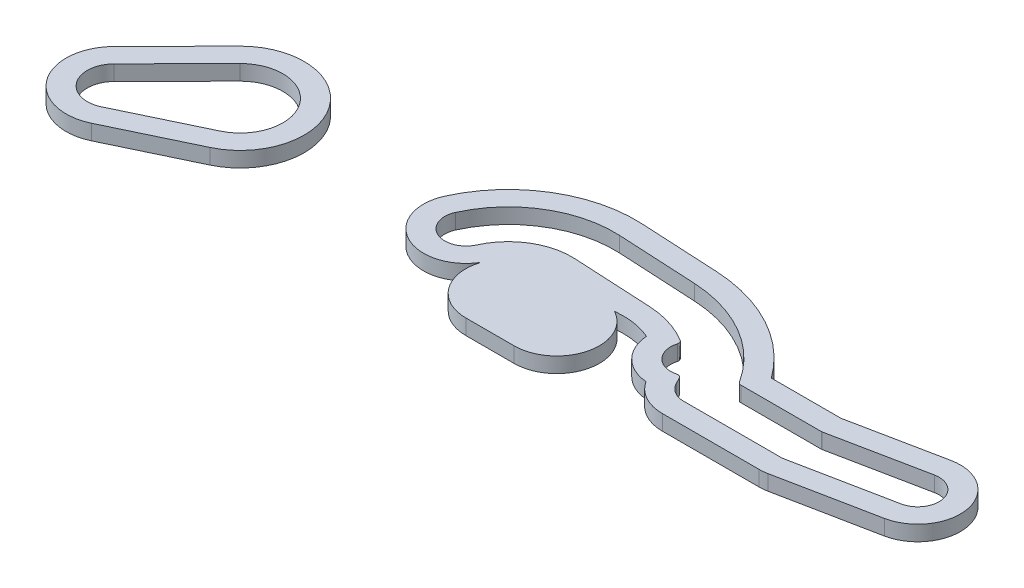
ISO-10303-21;
HEADER;
FILE_DESCRIPTION(('STEP AP214'),'2;1');
FILE_NAME('part.step','',(''),(''),'','','');
FILE_SCHEMA(('AUTOMOTIVE_DESIGN { 1 0 10303 214 1 1 1 1 }'));
ENDSEC;
DATA;
#1=APPLICATION_CONTEXT('core data for automotive mechanical design processes');
#2=APPLICATION_PROTOCOL_DEFINITION('international standard','automotive_design',2000,#1);
#3=PRODUCT_CONTEXT('',#1,'mechanical');
#4=PRODUCT('Part','Part','',(#3));
#5=PRODUCT_RELATED_PRODUCT_CATEGORY('part','',(#4));
#6=PRODUCT_DEFINITION_FORMATION('','',#4);
#7=PRODUCT_DEFINITION_CONTEXT('part definition',#1,'design');
#8=PRODUCT_DEFINITION('design','',#6,#7);
#9=PRODUCT_DEFINITION_SHAPE('','',#8);
#10=(LENGTH_UNIT() NAMED_UNIT(*) SI_UNIT(.MILLI.,.METRE.));
#11=(NAMED_UNIT(*) PLANE_ANGLE_UNIT() SI_UNIT($,.RADIAN.));
#12=(NAMED_UNIT(*) SI_UNIT($,.STERADIAN.) SOLID_ANGLE_UNIT());
#13=UNCERTAINTY_MEASURE_WITH_UNIT(LENGTH_MEASURE(1.E-05),#10,'distance_accuracy_value','');
#14=(GEOMETRIC_REPRESENTATION_CONTEXT(3) GLOBAL_UNCERTAINTY_ASSIGNED_CONTEXT((#13)) GLOBAL_UNIT_ASSIGNED_CONTEXT((#10,
#11,#12)) REPRESENTATION_CONTEXT('',''));
#15=CARTESIAN_POINT('',(0.,0.,0.));
#16=DIRECTION('',(0.,0.,1.));
#17=DIRECTION('',(1.,0.,0.));
#18=AXIS2_PLACEMENT_3D('',#15,#16,#17);
#19=CARTESIAN_POINT('',(28.65,-51.96,1.8));
#20=DIRECTION('',(0.,-1.,0.));
#21=DIRECTION('',(0.,0.,-1.));
#22=AXIS2_PLACEMENT_3D('',#19,#20,#21);
#23=CYLINDRICAL_SURFACE('',#22,2.2);
#24=CARTESIAN_POINT('',(28.65,-52.75,1.8));
#25=DIRECTION('',(0.,-1.,0.));
#26=DIRECTION('',(0.,0.,-1.));
#27=AXIS2_PLACEMENT_3D('',#24,#25,#26);
#28=CIRCLE('',#27,2.2);
#29=CARTESIAN_POINT('',(28.65,-52.75,4.));
#30=VERTEX_POINT('',#29);
#31=CARTESIAN_POINT('',(26.5547583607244,-52.75,1.12920757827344));
#32=VERTEX_POINT('',#31);
#33=EDGE_CURVE('E411',#30,#32,#28,.T.);
#34=ORIENTED_EDGE('',*,*,#33,.F.);
#35=DIRECTION('',(0.,-1.,0.));
#36=VECTOR('',#35,1.);
#37=CARTESIAN_POINT('',(28.65,-51.96,4.));
#38=LINE('',#37,#36);
#39=CARTESIAN_POINT('',(28.65,-51.96,4.));
#40=VERTEX_POINT('',#39);
#41=EDGE_CURVE('E12',#40,#30,#38,.T.);
#42=ORIENTED_EDGE('',*,*,#41,.F.);
#43=CARTESIAN_POINT('',(28.65,-51.96,1.8));
#44=DIRECTION('',(0.,-1.,0.));
#45=DIRECTION('',(0.,0.,-1.));
#46=AXIS2_PLACEMENT_3D('',#43,#44,#45);
#47=CIRCLE('',#46,2.2);
#48=CARTESIAN_POINT('',(26.5547583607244,-51.96,1.12920757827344));
#49=VERTEX_POINT('',#48);
#50=EDGE_CURVE('E447',#40,#49,#47,.T.);
#51=ORIENTED_EDGE('',*,*,#50,.T.);
#52=DIRECTION('',(0.,-1.,0.));
#53=VECTOR('',#52,1.);
#54=CARTESIAN_POINT('',(26.5547583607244,-51.96,1.12920757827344));
#55=LINE('',#54,#53);
#56=EDGE_CURVE('E52',#49,#32,#55,.T.);
#57=ORIENTED_EDGE('',*,*,#56,.T.);
#58=EDGE_LOOP('',(#34,#42,#51,#57));
#59=FACE_BOUND('',#58,.T.);
#60=ADVANCED_FACE('F49',(#59),#23,.T.);
#61=CARTESIAN_POINT('',(31.15,-51.96,4.));
#62=DIRECTION('',(0.,0.,1.));
#63=DIRECTION('',(1.,0.,0.));
#64=AXIS2_PLACEMENT_3D('',#61,#62,#63);
#65=PLANE('',#64);
#66=DIRECTION('',(-1.,0.,0.));
#67=VECTOR('',#66,1.);
#68=CARTESIAN_POINT('',(31.15,-52.75,4.));
#69=LINE('',#68,#67);
#70=CARTESIAN_POINT('',(31.15,-52.75,4.00000000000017));
#71=VERTEX_POINT('',#70);
#72=EDGE_CURVE('E451',#71,#30,#69,.T.);
#73=ORIENTED_EDGE('',*,*,#72,.F.);
#74=DIRECTION('',(0.,-1.,0.));
#75=VECTOR('',#74,1.);
#76=CARTESIAN_POINT('',(31.15,-51.96,4.00000000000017));
#77=LINE('',#76,#75);
#78=CARTESIAN_POINT('',(31.15,-51.96,4.00000000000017));
#79=VERTEX_POINT('',#78);
#80=EDGE_CURVE('E57',#79,#71,#77,.T.);
#81=ORIENTED_EDGE('',*,*,#80,.F.);
#82=DIRECTION('',(-1.,0.,0.));
#83=VECTOR('',#82,1.);
#84=CARTESIAN_POINT('',(31.15,-51.96,4.));
#85=LINE('',#84,#83);
#86=EDGE_CURVE('E493',#79,#40,#85,.T.);
#87=ORIENTED_EDGE('',*,*,#86,.T.);
#88=ORIENTED_EDGE('',*,*,#41,.T.);
#89=EDGE_LOOP('',(#73,#81,#87,#88));
#90=FACE_BOUND('',#89,.T.);
#91=ADVANCED_FACE('F580',(#90),#65,.T.);
#92=CARTESIAN_POINT('',(31.15,-51.96,1.8));
#93=DIRECTION('',(0.,-1.,0.));
#94=DIRECTION('',(0.,0.,-1.));
#95=AXIS2_PLACEMENT_3D('',#92,#93,#94);
#96=CYLINDRICAL_SURFACE('',#95,2.20000000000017);
#97=CARTESIAN_POINT('',(31.15,-52.75,1.8));
#98=DIRECTION('',(0.,-1.,0.));
#99=DIRECTION('',(0.,0.,-1.));
#100=AXIS2_PLACEMENT_3D('',#97,#98,#99);
#101=CIRCLE('',#100,2.20000000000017);
#102=CARTESIAN_POINT('',(32.1977058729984,-52.75,-0.134505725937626));
#103=VERTEX_POINT('',#102);
#104=EDGE_CURVE('E537',#103,#71,#101,.T.);
#105=ORIENTED_EDGE('',*,*,#104,.F.);
#106=DIRECTION('',(0.,-1.,0.));
#107=VECTOR('',#106,1.);
#108=CARTESIAN_POINT('',(32.1977058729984,-51.96,-0.134505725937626));
#109=LINE('',#108,#107);
#110=CARTESIAN_POINT('',(32.1977058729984,-51.96,-0.134505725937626));
#111=VERTEX_POINT('',#110);
#112=EDGE_CURVE('E543',#111,#103,#109,.T.);
#113=ORIENTED_EDGE('',*,*,#112,.F.);
#114=CARTESIAN_POINT('',(31.15,-51.96,1.8));
#115=DIRECTION('',(0.,-1.,0.));
#116=DIRECTION('',(0.,0.,-1.));
#117=AXIS2_PLACEMENT_3D('',#114,#115,#116);
#118=CIRCLE('',#117,2.20000000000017);
#119=EDGE_CURVE('E490',#111,#79,#118,.T.);
#120=ORIENTED_EDGE('',*,*,#119,.T.);
#121=ORIENTED_EDGE('',*,*,#80,.T.);
#122=EDGE_LOOP('',(#105,#113,#120,#121));
#123=FACE_BOUND('',#122,.T.);
#124=ADVANCED_FACE('F631',(#123),#96,.T.);
#125=CARTESIAN_POINT('',(32.6356706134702,-51.96,3.60199531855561));
#126=DIRECTION('',(0.,-1.,0.));
#127=DIRECTION('',(0.,0.,-1.));
#128=AXIS2_PLACEMENT_3D('',#125,#126,#127);
#129=CYLINDRICAL_SURFACE('',#128,3.76208096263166);
#130=CARTESIAN_POINT('',(32.6356706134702,-52.75,3.60199531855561));
#131=DIRECTION('',(0.,1.,0.));
#132=DIRECTION('',(0.,0.,-1.));
#133=AXIS2_PLACEMENT_3D('',#130,#131,#132);
#134=CIRCLE('',#133,3.76208096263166);
#135=CARTESIAN_POINT('',(34.1386734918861,-52.75,0.153193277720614));
#136=VERTEX_POINT('',#135);
#137=EDGE_CURVE('E534',#136,#103,#134,.T.);
#138=ORIENTED_EDGE('',*,*,#137,.F.);
#139=DIRECTION('',(0.,-1.,0.));
#140=VECTOR('',#139,1.);
#141=CARTESIAN_POINT('',(34.1386734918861,-51.96,0.153193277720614));
#142=LINE('',#141,#140);
#143=CARTESIAN_POINT('',(34.1386734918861,-51.96,0.153193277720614));
#144=VERTEX_POINT('',#143);
#145=EDGE_CURVE('E545',#144,#136,#142,.T.);
#146=ORIENTED_EDGE('',*,*,#145,.F.);
#147=CARTESIAN_POINT('',(32.6356706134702,-51.96,3.60199531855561));
#148=DIRECTION('',(0.,1.,0.));
#149=DIRECTION('',(0.,0.,-1.));
#150=AXIS2_PLACEMENT_3D('',#147,#148,#149);
#151=CIRCLE('',#150,3.76208096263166);
#152=EDGE_CURVE('E487',#144,#111,#151,.T.);
#153=ORIENTED_EDGE('',*,*,#152,.T.);
#154=ORIENTED_EDGE('',*,*,#112,.T.);
#155=EDGE_LOOP('',(#138,#146,#153,#154));
#156=FACE_BOUND('',#155,.T.);
#157=ADVANCED_FACE('F629',(#156),#129,.F.);
#158=CARTESIAN_POINT('',(36.3333333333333,-51.96,0.));
#159=DIRECTION('',(0.,-1.,0.));
#160=DIRECTION('',(0.,0.,-1.));
#161=AXIS2_PLACEMENT_3D('',#158,#159,#160);
#162=CYLINDRICAL_SURFACE('',#161,2.20000000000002);
#163=CARTESIAN_POINT('',(36.3333333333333,-52.75,0.));
#164=DIRECTION('',(0.,-1.,0.));
#165=DIRECTION('',(0.,0.,-1.));
#166=AXIS2_PLACEMENT_3D('',#163,#164,#165);
#167=CIRCLE('',#166,2.20000000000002);
#168=CARTESIAN_POINT('',(36.1511980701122,-52.75,2.19244766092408));
#169=VERTEX_POINT('',#168);
#170=EDGE_CURVE('E531',#169,#136,#167,.T.);
#171=ORIENTED_EDGE('',*,*,#170,.F.);
#172=DIRECTION('',(0.,-1.,0.));
#173=VECTOR('',#172,1.);
#174=CARTESIAN_POINT('',(36.1511980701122,-51.96,2.19244766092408));
#175=LINE('',#174,#173);
#176=CARTESIAN_POINT('',(36.1511980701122,-51.96,2.19244766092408));
#177=VERTEX_POINT('',#176);
#178=EDGE_CURVE('E547',#177,#169,#175,.T.);
#179=ORIENTED_EDGE('',*,*,#178,.F.);
#180=CARTESIAN_POINT('',(36.3333333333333,-51.96,0.));
#181=DIRECTION('',(0.,-1.,0.));
#182=DIRECTION('',(0.,0.,-1.));
#183=AXIS2_PLACEMENT_3D('',#180,#181,#182);
#184=CIRCLE('',#183,2.20000000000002);
#185=EDGE_CURVE('E484',#177,#144,#184,.T.);
#186=ORIENTED_EDGE('',*,*,#185,.T.);
#187=ORIENTED_EDGE('',*,*,#145,.T.);
#188=EDGE_LOOP('',(#171,#179,#186,#187));
#189=FACE_BOUND('',#188,.T.);
#190=ADVANCED_FACE('F625',(#189),#162,.T.);
#191=CARTESIAN_POINT('',(38.,-51.96,1.));
#192=DIRECTION('',(0.,-1.,0.));
#193=DIRECTION('',(0.,0.,-1.));
#194=AXIS2_PLACEMENT_3D('',#191,#192,#193);
#195=CYLINDRICAL_SURFACE('',#194,2.20000000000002);
#196=CARTESIAN_POINT('',(38.,-52.75,1.));
#197=DIRECTION('',(0.,-1.,0.));
#198=DIRECTION('',(0.,0.,-1.));
#199=AXIS2_PLACEMENT_3D('',#196,#197,#198);
#200=CIRCLE('',#199,2.20000000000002);
#201=CARTESIAN_POINT('',(38.,-52.75,3.2));
#202=VERTEX_POINT('',#201);
#203=EDGE_CURVE('E528',#202,#169,#200,.T.);
#204=ORIENTED_EDGE('',*,*,#203,.F.);
#205=DIRECTION('',(0.,-1.,0.));
#206=VECTOR('',#205,1.);
#207=CARTESIAN_POINT('',(38.,-51.96,3.2));
#208=LINE('',#207,#206);
#209=CARTESIAN_POINT('',(38.,-51.96,3.2));
#210=VERTEX_POINT('',#209);
#211=EDGE_CURVE('E549',#210,#202,#208,.T.);
#212=ORIENTED_EDGE('',*,*,#211,.F.);
#213=CARTESIAN_POINT('',(38.,-51.96,1.));
#214=DIRECTION('',(0.,-1.,0.));
#215=DIRECTION('',(0.,0.,-1.));
#216=AXIS2_PLACEMENT_3D('',#213,#214,#215);
#217=CIRCLE('',#216,2.20000000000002);
#218=EDGE_CURVE('E481',#210,#177,#217,.T.);
#219=ORIENTED_EDGE('',*,*,#218,.T.);
#220=ORIENTED_EDGE('',*,*,#178,.T.);
#221=EDGE_LOOP('',(#204,#212,#219,#220));
#222=FACE_BOUND('',#221,.T.);
#223=ADVANCED_FACE('F621',(#222),#195,.T.);
#224=CARTESIAN_POINT('',(43.,-51.96,3.2));
#225=DIRECTION('',(0.,0.,1.));
#226=DIRECTION('',(1.,0.,0.));
#227=AXIS2_PLACEMENT_3D('',#224,#225,#226);
#228=PLANE('',#227);
#229=DIRECTION('',(-1.,0.,0.));
#230=VECTOR('',#229,1.);
#231=CARTESIAN_POINT('',(43.,-52.75,3.2));
#232=LINE('',#231,#230);
#233=CARTESIAN_POINT('',(43.,-52.75,3.2));
#234=VERTEX_POINT('',#233);
#235=EDGE_CURVE('E525',#234,#202,#232,.T.);
#236=ORIENTED_EDGE('',*,*,#235,.F.);
#237=DIRECTION('',(0.,-1.,0.));
#238=VECTOR('',#237,1.);
#239=CARTESIAN_POINT('',(43.,-51.96,3.2));
#240=LINE('',#239,#238);
#241=CARTESIAN_POINT('',(43.,-51.96,3.2));
#242=VERTEX_POINT('',#241);
#243=EDGE_CURVE('E551',#242,#234,#240,.T.);
#244=ORIENTED_EDGE('',*,*,#243,.F.);
#245=DIRECTION('',(-1.,0.,0.));
#246=VECTOR('',#245,1.);
#247=CARTESIAN_POINT('',(43.,-51.96,3.2));
#248=LINE('',#247,#246);
#249=EDGE_CURVE('E478',#242,#210,#248,.T.);
#250=ORIENTED_EDGE('',*,*,#249,.T.);
#251=ORIENTED_EDGE('',*,*,#211,.T.);
#252=EDGE_LOOP('',(#236,#244,#250,#251));
#253=FACE_BOUND('',#252,.T.);
#254=ADVANCED_FACE('F617',(#253),#228,.T.);
#255=CARTESIAN_POINT('',(43.,-51.96,1.));
#256=DIRECTION('',(0.,-1.,0.));
#257=DIRECTION('',(0.,0.,-1.));
#258=AXIS2_PLACEMENT_3D('',#255,#256,#257);
#259=CYLINDRICAL_SURFACE('',#258,2.2);
#260=CARTESIAN_POINT('',(43.,-52.75,1.));
#261=DIRECTION('',(0.,-1.,0.));
#262=DIRECTION('',(0.,0.,-1.));
#263=AXIS2_PLACEMENT_3D('',#260,#261,#262);
#264=CIRCLE('',#263,2.2);
#265=CARTESIAN_POINT('',(43.431455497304,-52.75,3.15727748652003));
#266=VERTEX_POINT('',#265);
#267=EDGE_CURVE('E522',#266,#234,#264,.T.);
#268=ORIENTED_EDGE('',*,*,#267,.F.);
#269=DIRECTION('',(0.,-1.,0.));
#270=VECTOR('',#269,1.);
#271=CARTESIAN_POINT('',(43.431455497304,-51.96,3.15727748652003));
#272=LINE('',#271,#270);
#273=CARTESIAN_POINT('',(43.431455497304,-51.96,3.15727748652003));
#274=VERTEX_POINT('',#273);
#275=EDGE_CURVE('E553',#274,#266,#272,.T.);
#276=ORIENTED_EDGE('',*,*,#275,.F.);
#277=CARTESIAN_POINT('',(43.,-51.96,1.));
#278=DIRECTION('',(0.,-1.,0.));
#279=DIRECTION('',(0.,0.,-1.));
#280=AXIS2_PLACEMENT_3D('',#277,#278,#279);
#281=CIRCLE('',#280,2.2);
#282=EDGE_CURVE('E475',#274,#242,#281,.T.);
#283=ORIENTED_EDGE('',*,*,#282,.T.);
#284=ORIENTED_EDGE('',*,*,#243,.T.);
#285=EDGE_LOOP('',(#268,#276,#283,#284));
#286=FACE_BOUND('',#285,.T.);
#287=ADVANCED_FACE('F613',(#286),#259,.T.);
#288=CARTESIAN_POINT('',(48.431455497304,-51.96,2.15727748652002));
#289=DIRECTION('',(0.196116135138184,0.,0.98058067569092));
#290=DIRECTION('',(0.98058067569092,0.,-0.196116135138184));
#291=AXIS2_PLACEMENT_3D('',#288,#289,#290);
#292=PLANE('',#291);
#293=DIRECTION('',(-0.98058067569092,0.,0.196116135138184));
#294=VECTOR('',#293,1.);
#295=CARTESIAN_POINT('',(48.431455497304,-52.75,2.15727748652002));
#296=LINE('',#295,#294);
#297=CARTESIAN_POINT('',(48.431455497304,-52.75,2.15727748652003));
#298=VERTEX_POINT('',#297);
#299=EDGE_CURVE('E519',#298,#266,#296,.T.);
#300=ORIENTED_EDGE('',*,*,#299,.F.);
#301=DIRECTION('',(0.,-1.,0.));
#302=VECTOR('',#301,1.);
#303=CARTESIAN_POINT('',(48.431455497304,-51.96,2.15727748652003));
#304=LINE('',#303,#302);
#305=CARTESIAN_POINT('',(48.431455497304,-51.96,2.15727748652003));
#306=VERTEX_POINT('',#305);
#307=EDGE_CURVE('E555',#306,#298,#304,.T.);
#308=ORIENTED_EDGE('',*,*,#307,.F.);
#309=DIRECTION('',(-0.98058067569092,0.,0.196116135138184));
#310=VECTOR('',#309,1.);
#311=CARTESIAN_POINT('',(48.431455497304,-51.96,2.15727748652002));
#312=LINE('',#311,#310);
#313=EDGE_CURVE('E472',#306,#274,#312,.T.);
#314=ORIENTED_EDGE('',*,*,#313,.T.);
#315=ORIENTED_EDGE('',*,*,#275,.T.);
#316=EDGE_LOOP('',(#300,#308,#314,#315));
#317=FACE_BOUND('',#316,.T.);
#318=ADVANCED_FACE('F609',(#317),#292,.T.);
#319=CARTESIAN_POINT('',(48.,-51.96,0.));
#320=DIRECTION('',(0.,-1.,0.));
#321=DIRECTION('',(0.,0.,-1.));
#322=AXIS2_PLACEMENT_3D('',#319,#320,#321);
#323=CYLINDRICAL_SURFACE('',#322,2.2);
#324=CARTESIAN_POINT('',(48.,-52.75,0.));
#325=DIRECTION('',(0.,-1.,0.));
#326=DIRECTION('',(0.,0.,-1.));
#327=AXIS2_PLACEMENT_3D('',#324,#325,#326);
#328=CIRCLE('',#327,2.2);
#329=CARTESIAN_POINT('',(47.5643564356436,-52.75,-2.15643564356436));
#330=VERTEX_POINT('',#329);
#331=EDGE_CURVE('E516',#330,#298,#328,.T.);
#332=ORIENTED_EDGE('',*,*,#331,.F.);
#333=DIRECTION('',(0.,-1.,0.));
#334=VECTOR('',#333,1.);
#335=CARTESIAN_POINT('',(47.5643564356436,-51.96,-2.15643564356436));
#336=LINE('',#335,#334);
#337=CARTESIAN_POINT('',(47.5643564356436,-51.96,-2.15643564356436));
#338=VERTEX_POINT('',#337);
#339=EDGE_CURVE('E557',#338,#330,#336,.T.);
#340=ORIENTED_EDGE('',*,*,#339,.F.);
#341=CARTESIAN_POINT('',(48.,-51.96,0.));
#342=DIRECTION('',(0.,-1.,0.));
#343=DIRECTION('',(0.,0.,-1.));
#344=AXIS2_PLACEMENT_3D('',#341,#342,#343);
#345=CIRCLE('',#344,2.2);
#346=EDGE_CURVE('E469',#338,#306,#345,.T.);
#347=ORIENTED_EDGE('',*,*,#346,.T.);
#348=ORIENTED_EDGE('',*,*,#307,.T.);
#349=EDGE_LOOP('',(#332,#340,#347,#348));
#350=FACE_BOUND('',#349,.T.);
#351=ADVANCED_FACE('F605',(#350),#323,.T.);
#352=CARTESIAN_POINT('',(42.83,-51.96,-1.2));
#353=DIRECTION('',(-0.198019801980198,0.,-0.98019801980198));
#354=DIRECTION('',(-0.98019801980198,0.,0.198019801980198));
#355=AXIS2_PLACEMENT_3D('',#352,#353,#354);
#356=PLANE('',#355);
#357=DIRECTION('',(0.98019801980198,0.,-0.198019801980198));
#358=VECTOR('',#357,1.);
#359=CARTESIAN_POINT('',(42.83,-52.75,-1.2));
#360=LINE('',#359,#358);
#361=CARTESIAN_POINT('',(42.83,-52.75,-1.2));
#362=VERTEX_POINT('',#361);
#363=EDGE_CURVE('E513',#362,#330,#360,.T.);
#364=ORIENTED_EDGE('',*,*,#363,.F.);
#365=DIRECTION('',(0.,-1.,0.));
#366=VECTOR('',#365,1.);
#367=CARTESIAN_POINT('',(42.83,-51.96,-1.2));
#368=LINE('',#367,#366);
#369=CARTESIAN_POINT('',(42.83,-51.96,-1.2));
#370=VERTEX_POINT('',#369);
#371=EDGE_CURVE('E559',#370,#362,#368,.T.);
#372=ORIENTED_EDGE('',*,*,#371,.F.);
#373=DIRECTION('',(0.98019801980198,0.,-0.198019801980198));
#374=VECTOR('',#373,1.);
#375=CARTESIAN_POINT('',(42.83,-51.96,-1.2));
#376=LINE('',#375,#374);
#377=EDGE_CURVE('E466',#370,#338,#376,.T.);
#378=ORIENTED_EDGE('',*,*,#377,.T.);
#379=ORIENTED_EDGE('',*,*,#339,.T.);
#380=EDGE_LOOP('',(#364,#372,#378,#379));
#381=FACE_BOUND('',#380,.T.);
#382=ADVANCED_FACE('F601',(#381),#356,.T.);
#383=CARTESIAN_POINT('',(39.2357014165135,-51.96,-1.2));
#384=DIRECTION('',(0.,0.,-1.));
#385=DIRECTION('',(-1.,0.,0.));
#386=AXIS2_PLACEMENT_3D('',#383,#384,#385);
#387=PLANE('',#386);
#388=DIRECTION('',(1.,0.,0.));
#389=VECTOR('',#388,1.);
#390=CARTESIAN_POINT('',(39.2357014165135,-52.75,-1.2));
#391=LINE('',#390,#389);
#392=CARTESIAN_POINT('',(39.2357014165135,-52.75,-1.2));
#393=VERTEX_POINT('',#392);
#394=EDGE_CURVE('E510',#393,#362,#391,.T.);
#395=ORIENTED_EDGE('',*,*,#394,.F.);
#396=DIRECTION('',(0.,-1.,0.));
#397=VECTOR('',#396,1.);
#398=CARTESIAN_POINT('',(39.2357014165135,-51.96,-1.2));
#399=LINE('',#398,#397);
#400=CARTESIAN_POINT('',(39.2357014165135,-51.96,-1.2));
#401=VERTEX_POINT('',#400);
#402=EDGE_CURVE('E561',#401,#393,#399,.T.);
#403=ORIENTED_EDGE('',*,*,#402,.F.);
#404=DIRECTION('',(1.,0.,0.));
#405=VECTOR('',#404,1.);
#406=CARTESIAN_POINT('',(39.2357014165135,-51.96,-1.2));
#407=LINE('',#406,#405);
#408=EDGE_CURVE('E463',#401,#370,#407,.T.);
#409=ORIENTED_EDGE('',*,*,#408,.T.);
#410=ORIENTED_EDGE('',*,*,#371,.T.);
#411=EDGE_LOOP('',(#395,#403,#409,#410));
#412=FACE_BOUND('',#411,.T.);
#413=ADVANCED_FACE('F597',(#412),#387,.T.);
#414=CARTESIAN_POINT('',(32.6356706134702,-51.96,3.60199531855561));
#415=DIRECTION('',(0.,-1.,0.));
#416=DIRECTION('',(0.,0.,-1.));
#417=AXIS2_PLACEMENT_3D('',#414,#415,#416);
#418=CYLINDRICAL_SURFACE('',#417,8.16208096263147);
#419=CARTESIAN_POINT('',(32.6356706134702,-52.75,3.60199531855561));
#420=DIRECTION('',(0.,-1.,0.));
#421=DIRECTION('',(0.,0.,-1.));
#422=AXIS2_PLACEMENT_3D('',#419,#420,#421);
#423=CIRCLE('',#422,8.16208096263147);
#424=CARTESIAN_POINT('',(33.0628409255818,-52.75,-4.54889979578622));
#425=VERTEX_POINT('',#424);
#426=EDGE_CURVE('E507',#425,#393,#423,.T.);
#427=ORIENTED_EDGE('',*,*,#426,.F.);
#428=DIRECTION('',(0.,-1.,0.));
#429=VECTOR('',#428,1.);
#430=CARTESIAN_POINT('',(33.0628409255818,-51.96,-4.54889979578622));
#431=LINE('',#430,#429);
#432=CARTESIAN_POINT('',(33.0628409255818,-51.96,-4.54889979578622));
#433=VERTEX_POINT('',#432);
#434=EDGE_CURVE('E563',#433,#425,#431,.T.);
#435=ORIENTED_EDGE('',*,*,#434,.F.);
#436=CARTESIAN_POINT('',(32.6356706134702,-51.96,3.60199531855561));
#437=DIRECTION('',(0.,-1.,0.));
#438=DIRECTION('',(0.,0.,-1.));
#439=AXIS2_PLACEMENT_3D('',#436,#437,#438);
#440=CIRCLE('',#439,8.16208096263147);
#441=EDGE_CURVE('E460',#433,#401,#440,.T.);
#442=ORIENTED_EDGE('',*,*,#441,.T.);
#443=ORIENTED_EDGE('',*,*,#402,.T.);
#444=EDGE_LOOP('',(#427,#435,#442,#443));
#445=FACE_BOUND('',#444,.T.);
#446=ADVANCED_FACE('F593',(#445),#418,.T.);
#447=CARTESIAN_POINT('',(28.9939073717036,-51.96,-4.7621435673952));
#448=DIRECTION('',(0.0523359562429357,0.,-0.998629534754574));
#449=DIRECTION('',(-0.998629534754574,0.,-0.0523359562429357));
#450=AXIS2_PLACEMENT_3D('',#447,#448,#449);
#451=PLANE('',#450);
#452=DIRECTION('',(0.998629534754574,0.,0.0523359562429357));
#453=VECTOR('',#452,1.);
#454=CARTESIAN_POINT('',(28.9939073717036,-52.75,-4.7621435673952));
#455=LINE('',#454,#453);
#456=CARTESIAN_POINT('',(28.9939073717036,-52.75,-4.7621435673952));
#457=VERTEX_POINT('',#456);
#458=EDGE_CURVE('E504',#457,#425,#455,.T.);
#459=ORIENTED_EDGE('',*,*,#458,.F.);
#460=DIRECTION('',(0.,-1.,0.));
#461=VECTOR('',#460,1.);
#462=CARTESIAN_POINT('',(28.9939073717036,-51.96,-4.7621435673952));
#463=LINE('',#462,#461);
#464=CARTESIAN_POINT('',(28.9939073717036,-51.96,-4.7621435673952));
#465=VERTEX_POINT('',#464);
#466=EDGE_CURVE('E565',#465,#457,#463,.T.);
#467=ORIENTED_EDGE('',*,*,#466,.F.);
#468=DIRECTION('',(0.998629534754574,0.,0.0523359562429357));
#469=VECTOR('',#468,1.);
#470=CARTESIAN_POINT('',(28.9939073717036,-51.96,-4.7621435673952));
#471=LINE('',#470,#469);
#472=EDGE_CURVE('E457',#465,#433,#471,.T.);
#473=ORIENTED_EDGE('',*,*,#472,.T.);
#474=ORIENTED_EDGE('',*,*,#434,.T.);
#475=EDGE_LOOP('',(#459,#467,#473,#474));
#476=FACE_BOUND('',#475,.T.);
#477=ADVANCED_FACE('F591',(#476),#451,.T.);
#478=CARTESIAN_POINT('',(28.65,-51.96,1.8));
#479=DIRECTION('',(0.,-1.,0.));
#480=DIRECTION('',(0.,0.,-1.));
#481=AXIS2_PLACEMENT_3D('',#478,#479,#480);
#482=CYLINDRICAL_SURFACE('',#481,6.57114909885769);
#483=CARTESIAN_POINT('',(28.65,-52.75,1.8));
#484=DIRECTION('',(0.,-1.,0.));
#485=DIRECTION('',(0.,0.,-1.));
#486=AXIS2_PLACEMENT_3D('',#483,#484,#485);
#487=CIRCLE('',#486,6.57114909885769);
#488=CARTESIAN_POINT('',(22.6618543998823,-52.75,-0.90594027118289));
#489=VERTEX_POINT('',#488);
#490=EDGE_CURVE('E501',#489,#457,#487,.T.);
#491=ORIENTED_EDGE('',*,*,#490,.F.);
#492=DIRECTION('',(0.,-1.,0.));
#493=VECTOR('',#492,1.);
#494=CARTESIAN_POINT('',(22.6618543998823,-51.96,-0.90594027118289));
#495=LINE('',#494,#493);
#496=CARTESIAN_POINT('',(22.6618543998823,-51.96,-0.90594027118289));
#497=VERTEX_POINT('',#496);
#498=EDGE_CURVE('E566',#497,#489,#495,.T.);
#499=ORIENTED_EDGE('',*,*,#498,.F.);
#500=CARTESIAN_POINT('',(28.65,-51.96,1.8));
#501=DIRECTION('',(0.,-1.,0.));
#502=DIRECTION('',(0.,0.,-1.));
#503=AXIS2_PLACEMENT_3D('',#500,#501,#502);
#504=CIRCLE('',#503,6.57114909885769);
#505=EDGE_CURVE('E454',#497,#465,#504,.T.);
#506=ORIENTED_EDGE('',*,*,#505,.T.);
#507=ORIENTED_EDGE('',*,*,#466,.T.);
#508=EDGE_LOOP('',(#491,#499,#506,#507));
#509=FACE_BOUND('',#508,.T.);
#510=ADVANCED_FACE('F587',(#509),#482,.T.);
#511=CARTESIAN_POINT('',(24.6666666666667,-51.96,0.));
#512=DIRECTION('',(0.,-1.,0.));
#513=DIRECTION('',(0.,0.,-1.));
#514=AXIS2_PLACEMENT_3D('',#511,#512,#513);
#515=CYLINDRICAL_SURFACE('',#514,2.2);
#516=CARTESIAN_POINT('',(24.6666666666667,-52.75,0.));
#517=DIRECTION('',(0.,-1.,0.));
#518=DIRECTION('',(0.,0.,-1.));
#519=AXIS2_PLACEMENT_3D('',#516,#517,#518);
#520=CIRCLE('',#519,2.2);
#521=EDGE_CURVE('E498',#32,#489,#520,.T.);
#522=ORIENTED_EDGE('',*,*,#521,.F.);
#523=ORIENTED_EDGE('',*,*,#56,.F.);
#524=CARTESIAN_POINT('',(24.6666666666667,-51.96,0.));
#525=DIRECTION('',(0.,-1.,0.));
#526=DIRECTION('',(0.,0.,-1.));
#527=AXIS2_PLACEMENT_3D('',#524,#525,#526);
#528=CIRCLE('',#527,2.2);
#529=EDGE_CURVE('E450',#49,#497,#528,.T.);
#530=ORIENTED_EDGE('',*,*,#529,.T.);
#531=ORIENTED_EDGE('',*,*,#498,.T.);
#532=EDGE_LOOP('',(#522,#523,#530,#531));
#533=FACE_BOUND('',#532,.T.);
#534=ADVANCED_FACE('F574',(#533),#515,.T.);
#535=CARTESIAN_POINT('',(28.65,-51.96,1.8));
#536=DIRECTION('',(0.,-1.,0.));
#537=DIRECTION('',(0.,0.,-1.));
#538=AXIS2_PLACEMENT_3D('',#535,#536,#537);
#539=PLANE('',#538);
#540=DIRECTION('',(1.,0.,0.));
#541=VECTOR('',#540,1.);
#542=CARTESIAN_POINT('',(38.7603952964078,-51.96,-0.0999999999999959));
#543=LINE('',#542,#541);
#544=CARTESIAN_POINT('',(38.7603952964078,-51.96,-0.0999999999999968));
#545=VERTEX_POINT('',#544);
#546=CARTESIAN_POINT('',(42.92,-51.96,-0.100000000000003));
#547=VERTEX_POINT('',#546);
#548=EDGE_CURVE('E290',#545,#547,#543,.T.);
#549=ORIENTED_EDGE('',*,*,#548,.T.);
#550=CARTESIAN_POINT('',(42.92,-51.96,-0.300000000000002));
#551=DIRECTION('',(0.,1.,0.));
#552=DIRECTION('',(0.,0.,-1.));
#553=AXIS2_PLACEMENT_3D('',#550,#551,#552);
#554=CIRCLE('',#553,0.2);
#555=CARTESIAN_POINT('',(42.959603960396,-51.96,-0.103960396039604));
#556=VERTEX_POINT('',#555);
#557=EDGE_CURVE('E284',#547,#556,#554,.T.);
#558=ORIENTED_EDGE('',*,*,#557,.T.);
#559=DIRECTION('',(0.98019801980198,0.,-0.198019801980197));
#560=VECTOR('',#559,1.);
#561=CARTESIAN_POINT('',(42.959603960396,-51.96,-0.103960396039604));
#562=LINE('',#561,#560);
#563=CARTESIAN_POINT('',(47.7821782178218,-51.96,-1.07821782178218));
#564=VERTEX_POINT('',#563);
#565=EDGE_CURVE('E293',#556,#564,#562,.T.);
#566=ORIENTED_EDGE('',*,*,#565,.T.);
#567=CARTESIAN_POINT('',(48.,-51.96,0.));
#568=DIRECTION('',(0.,-1.,0.));
#569=DIRECTION('',(0.,0.,-1.));
#570=AXIS2_PLACEMENT_3D('',#567,#568,#569);
#571=CIRCLE('',#570,1.1);
#572=CARTESIAN_POINT('',(48.215727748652,-51.96,1.07863874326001));
#573=VERTEX_POINT('',#572);
#574=EDGE_CURVE('E65',#564,#573,#571,.T.);
#575=ORIENTED_EDGE('',*,*,#574,.T.);
#576=DIRECTION('',(-0.98058067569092,0.,0.196116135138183));
#577=VECTOR('',#576,1.);
#578=CARTESIAN_POINT('',(48.215727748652,-51.96,1.07863874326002));
#579=LINE('',#578,#577);
#580=CARTESIAN_POINT('',(43.215727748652,-51.96,2.07863874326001));
#581=VERTEX_POINT('',#580);
#582=EDGE_CURVE('E308',#573,#581,#579,.T.);
#583=ORIENTED_EDGE('',*,*,#582,.T.);
#584=CARTESIAN_POINT('',(43.,-51.96,1.));
#585=DIRECTION('',(0.,-1.,0.));
#586=DIRECTION('',(0.,0.,-1.));
#587=AXIS2_PLACEMENT_3D('',#584,#585,#586);
#588=CIRCLE('',#587,1.1);
#589=CARTESIAN_POINT('',(43.,-51.96,2.1));
#590=VERTEX_POINT('',#589);
#591=EDGE_CURVE('E311',#581,#590,#588,.T.);
#592=ORIENTED_EDGE('',*,*,#591,.T.);
#593=DIRECTION('',(-1.,0.,0.));
#594=VECTOR('',#593,1.);
#595=CARTESIAN_POINT('',(43.,-51.96,2.1));
#596=LINE('',#595,#594);
#597=CARTESIAN_POINT('',(38.,-51.96,2.1));
#598=VERTEX_POINT('',#597);
#599=EDGE_CURVE('E314',#590,#598,#596,.T.);
#600=ORIENTED_EDGE('',*,*,#599,.T.);
#601=CARTESIAN_POINT('',(38.,-51.96,1.));
#602=DIRECTION('',(0.,-1.,0.));
#603=DIRECTION('',(0.,0.,-1.));
#604=AXIS2_PLACEMENT_3D('',#601,#602,#603);
#605=CIRCLE('',#604,1.1);
#606=CARTESIAN_POINT('',(37.0102847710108,-51.96,1.4800664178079));
#607=VERTEX_POINT('',#606);
#608=EDGE_CURVE('E317',#598,#607,#605,.T.);
#609=ORIENTED_EDGE('',*,*,#608,.T.);
#610=CARTESIAN_POINT('',(32.6356706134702,-51.96,3.60199531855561));
#611=DIRECTION('',(0.,1.,0.));
#612=DIRECTION('',(0.,0.,-1.));
#613=AXIS2_PLACEMENT_3D('',#610,#611,#612);
#614=CIRCLE('',#613,4.86208096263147);
#615=CARTESIAN_POINT('',(36.8379007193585,-51.96,1.15636790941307));
#616=VERTEX_POINT('',#615);
#617=EDGE_CURVE('E320',#607,#616,#614,.T.);
#618=ORIENTED_EDGE('',*,*,#617,.T.);
#619=CARTESIAN_POINT('',(36.6650434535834,-51.96,1.25696793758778));
#620=DIRECTION('',(0.,1.,0.));
#621=DIRECTION('',(0.,0.,-1.));
#622=AXIS2_PLACEMENT_3D('',#619,#620,#621);
#623=CIRCLE('',#622,0.199999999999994);
#624=CARTESIAN_POINT('',(36.6140111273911,-51.96,1.06358825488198));
#625=VERTEX_POINT('',#624);
#626=EDGE_CURVE('E323',#616,#625,#623,.T.);
#627=ORIENTED_EDGE('',*,*,#626,.T.);
#628=CARTESIAN_POINT('',(36.3333333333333,-51.96,0.));
#629=DIRECTION('',(0.,-1.,0.));
#630=DIRECTION('',(0.,0.,-1.));
#631=AXIS2_PLACEMENT_3D('',#628,#629,#630);
#632=CIRCLE('',#631,1.1);
#633=CARTESIAN_POINT('',(35.2774660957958,-51.96,-0.308454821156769));
#634=VERTEX_POINT('',#633);
#635=EDGE_CURVE('E326',#625,#634,#632,.T.);
#636=ORIENTED_EDGE('',*,*,#635,.T.);
#637=CARTESIAN_POINT('',(35.0854902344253,-51.96,-0.36453751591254));
#638=DIRECTION('',(0.,1.,0.));
#639=DIRECTION('',(0.,0.,-1.));
#640=AXIS2_PLACEMENT_3D('',#637,#638,#639);
#641=CIRCLE('',#640,0.2);
#642=CARTESIAN_POINT('',(35.1905857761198,-51.96,-0.534698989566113));
#643=VERTEX_POINT('',#642);
#644=EDGE_CURVE('E329',#634,#643,#641,.T.);
#645=ORIENTED_EDGE('',*,*,#644,.T.);
#646=CARTESIAN_POINT('',(32.6356706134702,-51.96,3.60199531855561));
#647=DIRECTION('',(0.,1.,0.));
#648=DIRECTION('',(0.,0.,-1.));
#649=AXIS2_PLACEMENT_3D('',#646,#647,#648);
#650=CIRCLE('',#649,4.86208096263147);
#651=CARTESIAN_POINT('',(32.8901322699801,-51.96,-1.25342233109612));
#652=VERTEX_POINT('',#651);
#653=EDGE_CURVE('E332',#643,#652,#650,.T.);
#654=ORIENTED_EDGE('',*,*,#653,.T.);
#655=DIRECTION('',(-0.998629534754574,0.,-0.0523359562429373));
#656=VECTOR('',#655,1.);
#657=CARTESIAN_POINT('',(32.8901322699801,-51.96,-1.25342233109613));
#658=LINE('',#657,#656);
#659=CARTESIAN_POINT('',(28.8211987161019,-51.96,-1.46666610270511));
#660=VERTEX_POINT('',#659);
#661=EDGE_CURVE('E335',#652,#660,#658,.T.);
#662=ORIENTED_EDGE('',*,*,#661,.T.);
#663=CARTESIAN_POINT('',(28.65,-51.96,1.8));
#664=DIRECTION('',(0.,1.,0.));
#665=DIRECTION('',(0.,0.,-1.));
#666=AXIS2_PLACEMENT_3D('',#663,#664,#665);
#667=CIRCLE('',#666,3.2711490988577);
#668=CARTESIAN_POINT('',(25.6690728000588,-51.96,0.452970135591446));
#669=VERTEX_POINT('',#668);
#670=EDGE_CURVE('E338',#660,#669,#667,.T.);
#671=ORIENTED_EDGE('',*,*,#670,.T.);
#672=CARTESIAN_POINT('',(24.6666666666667,-51.96,0.));
#673=DIRECTION('',(0.,-1.,0.));
#674=DIRECTION('',(0.,0.,-1.));
#675=AXIS2_PLACEMENT_3D('',#672,#673,#674);
#676=CIRCLE('',#675,1.1);
#677=CARTESIAN_POINT('',(23.6642605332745,-51.96,-0.452970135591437));
#678=VERTEX_POINT('',#677);
#679=EDGE_CURVE('E341',#669,#678,#676,.T.);
#680=ORIENTED_EDGE('',*,*,#679,.T.);
#681=CARTESIAN_POINT('',(28.65,-51.96,1.8));
#682=DIRECTION('',(0.,-1.,0.));
#683=DIRECTION('',(0.,0.,-1.));
#684=AXIS2_PLACEMENT_3D('',#681,#682,#683);
#685=CIRCLE('',#684,5.47114909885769);
#686=CARTESIAN_POINT('',(28.9363378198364,-51.96,-3.66365107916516));
#687=VERTEX_POINT('',#686);
#688=EDGE_CURVE('E344',#678,#687,#685,.T.);
#689=ORIENTED_EDGE('',*,*,#688,.T.);
#690=DIRECTION('',(0.998629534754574,0.,0.0523359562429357));
#691=VECTOR('',#690,1.);
#692=CARTESIAN_POINT('',(28.9363378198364,-51.96,-3.66365107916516));
#693=LINE('',#692,#691);
#694=CARTESIAN_POINT('',(33.0052713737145,-51.96,-3.45040730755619));
#695=VERTEX_POINT('',#694);
#696=EDGE_CURVE('E347',#687,#695,#693,.T.);
#697=ORIENTED_EDGE('',*,*,#696,.T.);
#698=CARTESIAN_POINT('',(32.6356706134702,-51.96,3.60199531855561));
#699=DIRECTION('',(0.,-1.,0.));
#700=DIRECTION('',(0.,0.,-1.));
#701=AXIS2_PLACEMENT_3D('',#698,#699,#700);
#702=CIRCLE('',#701,7.06208096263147);
#703=CARTESIAN_POINT('',(38.5917184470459,-51.96,-0.192537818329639));
#704=VERTEX_POINT('',#703);
#705=EDGE_CURVE('E350',#695,#704,#702,.T.);
#706=ORIENTED_EDGE('',*,*,#705,.T.);
#707=CARTESIAN_POINT('',(38.7603952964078,-51.96,-0.300000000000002));
#708=DIRECTION('',(0.,1.,0.));
#709=DIRECTION('',(0.,0.,-1.));
#710=AXIS2_PLACEMENT_3D('',#707,#708,#709);
#711=CIRCLE('',#710,0.200000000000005);
#712=EDGE_CURVE('E353',#704,#545,#711,.T.);
#713=ORIENTED_EDGE('',*,*,#712,.T.);
#714=EDGE_LOOP('',(#549,#558,#566,#575,#583,#592,#600,#609,#618,#627,#636,#645,#654,#662,#671,
#680,#689,#697,#706,#713));
#715=FACE_BOUND('',#714,.T.);
#716=ORIENTED_EDGE('',*,*,#50,.F.);
#717=ORIENTED_EDGE('',*,*,#86,.F.);
#718=ORIENTED_EDGE('',*,*,#119,.F.);
#719=ORIENTED_EDGE('',*,*,#152,.F.);
#720=ORIENTED_EDGE('',*,*,#185,.F.);
#721=ORIENTED_EDGE('',*,*,#218,.F.);
#722=ORIENTED_EDGE('',*,*,#249,.F.);
#723=ORIENTED_EDGE('',*,*,#282,.F.);
#724=ORIENTED_EDGE('',*,*,#313,.F.);
#725=ORIENTED_EDGE('',*,*,#346,.F.);
#726=ORIENTED_EDGE('',*,*,#377,.F.);
#727=ORIENTED_EDGE('',*,*,#408,.F.);
#728=ORIENTED_EDGE('',*,*,#441,.F.);
#729=ORIENTED_EDGE('',*,*,#472,.F.);
#730=ORIENTED_EDGE('',*,*,#505,.F.);
#731=ORIENTED_EDGE('',*,*,#529,.F.);
#732=EDGE_LOOP('',(#716,#717,#718,#719,#720,#721,#722,#723,#724,#725,#726,#727,#728,#729,#730,#731));
#733=FACE_BOUND('',#732,.T.);
#734=ADVANCED_FACE('F297',(#715,#733),#539,.F.);
#735=CARTESIAN_POINT('',(28.65,-52.75,1.8));
#736=DIRECTION('',(0.,-1.,0.));
#737=DIRECTION('',(0.,0.,-1.));
#738=AXIS2_PLACEMENT_3D('',#735,#736,#737);
#739=PLANE('',#738);
#740=CARTESIAN_POINT('',(42.92,-52.75,-0.300000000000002));
#741=DIRECTION('',(0.,1.,0.));
#742=DIRECTION('',(0.,0.,-1.));
#743=AXIS2_PLACEMENT_3D('',#740,#741,#742);
#744=CIRCLE('',#743,0.2);
#745=CARTESIAN_POINT('',(42.92,-52.75,-0.100000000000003));
#746=VERTEX_POINT('',#745);
#747=CARTESIAN_POINT('',(42.959603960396,-52.75,-0.103960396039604));
#748=VERTEX_POINT('',#747);
#749=EDGE_CURVE('E73',#746,#748,#744,.T.);
#750=ORIENTED_EDGE('',*,*,#749,.F.);
#751=DIRECTION('',(1.,0.,0.));
#752=VECTOR('',#751,1.);
#753=CARTESIAN_POINT('',(38.7603952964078,-52.75,-0.0999999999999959));
#754=LINE('',#753,#752);
#755=CARTESIAN_POINT('',(38.7603952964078,-52.75,-0.0999999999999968));
#756=VERTEX_POINT('',#755);
#757=EDGE_CURVE('E301',#756,#746,#754,.T.);
#758=ORIENTED_EDGE('',*,*,#757,.F.);
#759=CARTESIAN_POINT('',(38.7603952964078,-52.75,-0.300000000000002));
#760=DIRECTION('',(0.,1.,0.));
#761=DIRECTION('',(0.,0.,-1.));
#762=AXIS2_PLACEMENT_3D('',#759,#760,#761);
#763=CIRCLE('',#762,0.200000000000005);
#764=CARTESIAN_POINT('',(38.5917184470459,-52.75,-0.192537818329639));
#765=VERTEX_POINT('',#764);
#766=EDGE_CURVE('E304',#765,#756,#763,.T.);
#767=ORIENTED_EDGE('',*,*,#766,.F.);
#768=CARTESIAN_POINT('',(32.6356706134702,-52.75,3.60199531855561));
#769=DIRECTION('',(0.,-1.,0.));
#770=DIRECTION('',(0.,0.,-1.));
#771=AXIS2_PLACEMENT_3D('',#768,#769,#770);
#772=CIRCLE('',#771,7.06208096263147);
#773=CARTESIAN_POINT('',(33.0052713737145,-52.75,-3.45040730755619));
#774=VERTEX_POINT('',#773);
#775=EDGE_CURVE('E404',#774,#765,#772,.T.);
#776=ORIENTED_EDGE('',*,*,#775,.F.);
#777=DIRECTION('',(0.998629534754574,0.,0.0523359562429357));
#778=VECTOR('',#777,1.);
#779=CARTESIAN_POINT('',(28.9363378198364,-52.75,-3.66365107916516));
#780=LINE('',#779,#778);
#781=CARTESIAN_POINT('',(28.9363378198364,-52.75,-3.66365107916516));
#782=VERTEX_POINT('',#781);
#783=EDGE_CURVE('E401',#782,#774,#780,.T.);
#784=ORIENTED_EDGE('',*,*,#783,.F.);
#785=CARTESIAN_POINT('',(28.65,-52.75,1.8));
#786=DIRECTION('',(0.,-1.,0.));
#787=DIRECTION('',(0.,0.,-1.));
#788=AXIS2_PLACEMENT_3D('',#785,#786,#787);
#789=CIRCLE('',#788,5.47114909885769);
#790=CARTESIAN_POINT('',(23.6642605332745,-52.75,-0.452970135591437));
#791=VERTEX_POINT('',#790);
#792=EDGE_CURVE('E398',#791,#782,#789,.T.);
#793=ORIENTED_EDGE('',*,*,#792,.F.);
#794=CARTESIAN_POINT('',(24.6666666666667,-52.75,0.));
#795=DIRECTION('',(0.,-1.,0.));
#796=DIRECTION('',(0.,0.,-1.));
#797=AXIS2_PLACEMENT_3D('',#794,#795,#796);
#798=CIRCLE('',#797,1.1);
#799=CARTESIAN_POINT('',(25.6690728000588,-52.75,0.452970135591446));
#800=VERTEX_POINT('',#799);
#801=EDGE_CURVE('E395',#800,#791,#798,.T.);
#802=ORIENTED_EDGE('',*,*,#801,.F.);
#803=CARTESIAN_POINT('',(28.65,-52.75,1.8));
#804=DIRECTION('',(0.,1.,0.));
#805=DIRECTION('',(0.,0.,-1.));
#806=AXIS2_PLACEMENT_3D('',#803,#804,#805);
#807=CIRCLE('',#806,3.2711490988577);
#808=CARTESIAN_POINT('',(28.8211987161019,-52.75,-1.46666610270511));
#809=VERTEX_POINT('',#808);
#810=EDGE_CURVE('E392',#809,#800,#807,.T.);
#811=ORIENTED_EDGE('',*,*,#810,.F.);
#812=DIRECTION('',(-0.998629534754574,0.,-0.0523359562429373));
#813=VECTOR('',#812,1.);
#814=CARTESIAN_POINT('',(32.8901322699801,-52.75,-1.25342233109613));
#815=LINE('',#814,#813);
#816=CARTESIAN_POINT('',(32.8901322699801,-52.75,-1.25342233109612));
#817=VERTEX_POINT('',#816);
#818=EDGE_CURVE('E389',#817,#809,#815,.T.);
#819=ORIENTED_EDGE('',*,*,#818,.F.);
#820=CARTESIAN_POINT('',(32.6356706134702,-52.75,3.60199531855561));
#821=DIRECTION('',(0.,1.,0.));
#822=DIRECTION('',(0.,0.,-1.));
#823=AXIS2_PLACEMENT_3D('',#820,#821,#822);
#824=CIRCLE('',#823,4.86208096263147);
#825=CARTESIAN_POINT('',(35.1905857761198,-52.75,-0.534698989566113));
#826=VERTEX_POINT('',#825);
#827=EDGE_CURVE('E386',#826,#817,#824,.T.);
#828=ORIENTED_EDGE('',*,*,#827,.F.);
#829=CARTESIAN_POINT('',(35.0854902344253,-52.75,-0.36453751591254));
#830=DIRECTION('',(0.,1.,0.));
#831=DIRECTION('',(0.,0.,-1.));
#832=AXIS2_PLACEMENT_3D('',#829,#830,#831);
#833=CIRCLE('',#832,0.2);
#834=CARTESIAN_POINT('',(35.2774660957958,-52.75,-0.308454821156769));
#835=VERTEX_POINT('',#834);
#836=EDGE_CURVE('E383',#835,#826,#833,.T.);
#837=ORIENTED_EDGE('',*,*,#836,.F.);
#838=CARTESIAN_POINT('',(36.3333333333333,-52.75,0.));
#839=DIRECTION('',(0.,-1.,0.));
#840=DIRECTION('',(0.,0.,-1.));
#841=AXIS2_PLACEMENT_3D('',#838,#839,#840);
#842=CIRCLE('',#841,1.1);
#843=CARTESIAN_POINT('',(36.6140111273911,-52.75,1.06358825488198));
#844=VERTEX_POINT('',#843);
#845=EDGE_CURVE('E380',#844,#835,#842,.T.);
#846=ORIENTED_EDGE('',*,*,#845,.F.);
#847=CARTESIAN_POINT('',(36.6650434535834,-52.75,1.25696793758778));
#848=DIRECTION('',(0.,1.,0.));
#849=DIRECTION('',(0.,0.,-1.));
#850=AXIS2_PLACEMENT_3D('',#847,#848,#849);
#851=CIRCLE('',#850,0.199999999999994);
#852=CARTESIAN_POINT('',(36.8379007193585,-52.75,1.15636790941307));
#853=VERTEX_POINT('',#852);
#854=EDGE_CURVE('E377',#853,#844,#851,.T.);
#855=ORIENTED_EDGE('',*,*,#854,.F.);
#856=CARTESIAN_POINT('',(32.6356706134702,-52.75,3.60199531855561));
#857=DIRECTION('',(0.,1.,0.));
#858=DIRECTION('',(0.,0.,-1.));
#859=AXIS2_PLACEMENT_3D('',#856,#857,#858);
#860=CIRCLE('',#859,4.86208096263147);
#861=CARTESIAN_POINT('',(37.0102847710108,-52.75,1.4800664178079));
#862=VERTEX_POINT('',#861);
#863=EDGE_CURVE('E374',#862,#853,#860,.T.);
#864=ORIENTED_EDGE('',*,*,#863,.F.);
#865=CARTESIAN_POINT('',(38.,-52.75,1.));
#866=DIRECTION('',(0.,-1.,0.));
#867=DIRECTION('',(0.,0.,-1.));
#868=AXIS2_PLACEMENT_3D('',#865,#866,#867);
#869=CIRCLE('',#868,1.1);
#870=CARTESIAN_POINT('',(38.,-52.75,2.1));
#871=VERTEX_POINT('',#870);
#872=EDGE_CURVE('E371',#871,#862,#869,.T.);
#873=ORIENTED_EDGE('',*,*,#872,.F.);
#874=DIRECTION('',(-1.,0.,0.));
#875=VECTOR('',#874,1.);
#876=CARTESIAN_POINT('',(43.,-52.75,2.1));
#877=LINE('',#876,#875);
#878=CARTESIAN_POINT('',(43.,-52.75,2.1));
#879=VERTEX_POINT('',#878);
#880=EDGE_CURVE('E368',#879,#871,#877,.T.);
#881=ORIENTED_EDGE('',*,*,#880,.F.);
#882=CARTESIAN_POINT('',(43.,-52.75,1.));
#883=DIRECTION('',(0.,-1.,0.));
#884=DIRECTION('',(0.,0.,-1.));
#885=AXIS2_PLACEMENT_3D('',#882,#883,#884);
#886=CIRCLE('',#885,1.1);
#887=CARTESIAN_POINT('',(43.215727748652,-52.75,2.07863874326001));
#888=VERTEX_POINT('',#887);
#889=EDGE_CURVE('E365',#888,#879,#886,.T.);
#890=ORIENTED_EDGE('',*,*,#889,.F.);
#891=DIRECTION('',(-0.98058067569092,0.,0.196116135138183));
#892=VECTOR('',#891,1.);
#893=CARTESIAN_POINT('',(48.215727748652,-52.75,1.07863874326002));
#894=LINE('',#893,#892);
#895=CARTESIAN_POINT('',(48.215727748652,-52.75,1.07863874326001));
#896=VERTEX_POINT('',#895);
#897=EDGE_CURVE('E362',#896,#888,#894,.T.);
#898=ORIENTED_EDGE('',*,*,#897,.F.);
#899=CARTESIAN_POINT('',(48.,-52.75,0.));
#900=DIRECTION('',(0.,-1.,0.));
#901=DIRECTION('',(0.,0.,-1.));
#902=AXIS2_PLACEMENT_3D('',#899,#900,#901);
#903=CIRCLE('',#902,1.1);
#904=CARTESIAN_POINT('',(47.7821782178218,-52.75,-1.07821782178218));
#905=VERTEX_POINT('',#904);
#906=EDGE_CURVE('E359',#905,#896,#903,.T.);
#907=ORIENTED_EDGE('',*,*,#906,.F.);
#908=DIRECTION('',(0.98019801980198,0.,-0.198019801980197));
#909=VECTOR('',#908,1.);
#910=CARTESIAN_POINT('',(42.959603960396,-52.75,-0.103960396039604));
#911=LINE('',#910,#909);
#912=EDGE_CURVE('E357',#748,#905,#911,.T.);
#913=ORIENTED_EDGE('',*,*,#912,.F.);
#914=EDGE_LOOP('',(#750,#758,#767,#776,#784,#793,#802,#811,#819,#828,#837,#846,#855,#864,#873,
#881,#890,#898,#907,#913));
#915=FACE_BOUND('',#914,.T.);
#916=ORIENTED_EDGE('',*,*,#33,.T.);
#917=ORIENTED_EDGE('',*,*,#521,.T.);
#918=ORIENTED_EDGE('',*,*,#490,.T.);
#919=ORIENTED_EDGE('',*,*,#458,.T.);
#920=ORIENTED_EDGE('',*,*,#426,.T.);
#921=ORIENTED_EDGE('',*,*,#394,.T.);
#922=ORIENTED_EDGE('',*,*,#363,.T.);
#923=ORIENTED_EDGE('',*,*,#331,.T.);
#924=ORIENTED_EDGE('',*,*,#299,.T.);
#925=ORIENTED_EDGE('',*,*,#267,.T.);
#926=ORIENTED_EDGE('',*,*,#235,.T.);
#927=ORIENTED_EDGE('',*,*,#203,.T.);
#928=ORIENTED_EDGE('',*,*,#170,.T.);
#929=ORIENTED_EDGE('',*,*,#137,.T.);
#930=ORIENTED_EDGE('',*,*,#104,.T.);
#931=ORIENTED_EDGE('',*,*,#72,.T.);
#932=EDGE_LOOP('',(#916,#917,#918,#919,#920,#921,#922,#923,#924,#925,#926,#927,#928,#929,#930,#931));
#933=FACE_BOUND('',#932,.T.);
#934=ADVANCED_FACE('F576',(#915,#933),#739,.T.);
#935=CARTESIAN_POINT('',(42.92,-51.96,-0.300000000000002));
#936=DIRECTION('',(0.,-1.,0.));
#937=DIRECTION('',(0.,0.,-1.));
#938=AXIS2_PLACEMENT_3D('',#935,#936,#937);
#939=CYLINDRICAL_SURFACE('',#938,0.2);
#940=ORIENTED_EDGE('',*,*,#749,.T.);
#941=DIRECTION('',(0.,-1.,0.));
#942=VECTOR('',#941,1.);
#943=CARTESIAN_POINT('',(42.959603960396,-51.96,-0.103960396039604));
#944=LINE('',#943,#942);
#945=EDGE_CURVE('E280',#556,#748,#944,.T.);
#946=ORIENTED_EDGE('',*,*,#945,.F.);
#947=ORIENTED_EDGE('',*,*,#557,.F.);
#948=DIRECTION('',(0.,-1.,0.));
#949=VECTOR('',#948,1.);
#950=CARTESIAN_POINT('',(42.92,-51.96,-0.100000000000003));
#951=LINE('',#950,#949);
#952=EDGE_CURVE('E409',#547,#746,#951,.T.);
#953=ORIENTED_EDGE('',*,*,#952,.T.);
#954=EDGE_LOOP('',(#940,#946,#947,#953));
#955=FACE_BOUND('',#954,.T.);
#956=ADVANCED_FACE('F282',(#955),#939,.T.);
#957=CARTESIAN_POINT('',(38.7603952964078,-51.96,-0.0999999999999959));
#958=DIRECTION('',(0.,0.,-1.));
#959=DIRECTION('',(-1.,0.,0.));
#960=AXIS2_PLACEMENT_3D('',#957,#958,#959);
#961=PLANE('',#960);
#962=ORIENTED_EDGE('',*,*,#757,.T.);
#963=ORIENTED_EDGE('',*,*,#952,.F.);
#964=ORIENTED_EDGE('',*,*,#548,.F.);
#965=DIRECTION('',(0.,-1.,0.));
#966=VECTOR('',#965,1.);
#967=CARTESIAN_POINT('',(38.7603952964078,-51.96,-0.0999999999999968));
#968=LINE('',#967,#966);
#969=EDGE_CURVE('E412',#545,#756,#968,.T.);
#970=ORIENTED_EDGE('',*,*,#969,.T.);
#971=EDGE_LOOP('',(#962,#963,#964,#970));
#972=FACE_BOUND('',#971,.T.);
#973=ADVANCED_FACE('F778',(#972),#961,.F.);
#974=CARTESIAN_POINT('',(38.7603952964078,-51.96,-0.300000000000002));
#975=DIRECTION('',(0.,-1.,0.));
#976=DIRECTION('',(0.,0.,-1.));
#977=AXIS2_PLACEMENT_3D('',#974,#975,#976);
#978=CYLINDRICAL_SURFACE('',#977,0.200000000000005);
#979=ORIENTED_EDGE('',*,*,#766,.T.);
#980=ORIENTED_EDGE('',*,*,#969,.F.);
#981=ORIENTED_EDGE('',*,*,#712,.F.);
#982=DIRECTION('',(0.,-1.,0.));
#983=VECTOR('',#982,1.);
#984=CARTESIAN_POINT('',(38.5917184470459,-51.96,-0.192537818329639));
#985=LINE('',#984,#983);
#986=EDGE_CURVE('E414',#704,#765,#985,.T.);
#987=ORIENTED_EDGE('',*,*,#986,.T.);
#988=EDGE_LOOP('',(#979,#980,#981,#987));
#989=FACE_BOUND('',#988,.T.);
#990=ADVANCED_FACE('F787',(#989),#978,.T.);
#991=CARTESIAN_POINT('',(32.6356706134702,-51.96,3.60199531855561));
#992=DIRECTION('',(0.,-1.,0.));
#993=DIRECTION('',(0.,0.,-1.));
#994=AXIS2_PLACEMENT_3D('',#991,#992,#993);
#995=CYLINDRICAL_SURFACE('',#994,7.06208096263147);
#996=ORIENTED_EDGE('',*,*,#775,.T.);
#997=ORIENTED_EDGE('',*,*,#986,.F.);
#998=ORIENTED_EDGE('',*,*,#705,.F.);
#999=DIRECTION('',(0.,-1.,0.));
#1000=VECTOR('',#999,1.);
#1001=CARTESIAN_POINT('',(33.0052713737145,-51.96,-3.45040730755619));
#1002=LINE('',#1001,#1000);
#1003=EDGE_CURVE('E416',#695,#774,#1002,.T.);
#1004=ORIENTED_EDGE('',*,*,#1003,.T.);
#1005=EDGE_LOOP('',(#996,#997,#998,#1004));
#1006=FACE_BOUND('',#1005,.T.);
#1007=ADVANCED_FACE('F797',(#1006),#995,.F.);
#1008=CARTESIAN_POINT('',(28.9363378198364,-51.96,-3.66365107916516));
#1009=DIRECTION('',(0.0523359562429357,0.,-0.998629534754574));
#1010=DIRECTION('',(-0.998629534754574,0.,-0.0523359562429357));
#1011=AXIS2_PLACEMENT_3D('',#1008,#1009,#1010);
#1012=PLANE('',#1011);
#1013=ORIENTED_EDGE('',*,*,#783,.T.);
#1014=ORIENTED_EDGE('',*,*,#1003,.F.);
#1015=ORIENTED_EDGE('',*,*,#696,.F.);
#1016=DIRECTION('',(0.,-1.,0.));
#1017=VECTOR('',#1016,1.);
#1018=CARTESIAN_POINT('',(28.9363378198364,-51.96,-3.66365107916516));
#1019=LINE('',#1018,#1017);
#1020=EDGE_CURVE('E418',#687,#782,#1019,.T.);
#1021=ORIENTED_EDGE('',*,*,#1020,.T.);
#1022=EDGE_LOOP('',(#1013,#1014,#1015,#1021));
#1023=FACE_BOUND('',#1022,.T.);
#1024=ADVANCED_FACE('F807',(#1023),#1012,.F.);
#1025=CARTESIAN_POINT('',(28.65,-51.96,1.8));
#1026=DIRECTION('',(0.,-1.,0.));
#1027=DIRECTION('',(0.,0.,-1.));
#1028=AXIS2_PLACEMENT_3D('',#1025,#1026,#1027);
#1029=CYLINDRICAL_SURFACE('',#1028,5.47114909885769);
#1030=ORIENTED_EDGE('',*,*,#792,.T.);
#1031=ORIENTED_EDGE('',*,*,#1020,.F.);
#1032=ORIENTED_EDGE('',*,*,#688,.F.);
#1033=DIRECTION('',(0.,-1.,0.));
#1034=VECTOR('',#1033,1.);
#1035=CARTESIAN_POINT('',(23.6642605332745,-51.96,-0.452970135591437));
#1036=LINE('',#1035,#1034);
#1037=EDGE_CURVE('E420',#678,#791,#1036,.T.);
#1038=ORIENTED_EDGE('',*,*,#1037,.T.);
#1039=EDGE_LOOP('',(#1030,#1031,#1032,#1038));
#1040=FACE_BOUND('',#1039,.T.);
#1041=ADVANCED_FACE('F817',(#1040),#1029,.F.);
#1042=CARTESIAN_POINT('',(24.6666666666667,-51.96,0.));
#1043=DIRECTION('',(0.,-1.,0.));
#1044=DIRECTION('',(0.,0.,-1.));
#1045=AXIS2_PLACEMENT_3D('',#1042,#1043,#1044);
#1046=CYLINDRICAL_SURFACE('',#1045,1.1);
#1047=ORIENTED_EDGE('',*,*,#801,.T.);
#1048=ORIENTED_EDGE('',*,*,#1037,.F.);
#1049=ORIENTED_EDGE('',*,*,#679,.F.);
#1050=DIRECTION('',(0.,-1.,0.));
#1051=VECTOR('',#1050,1.);
#1052=CARTESIAN_POINT('',(25.6690728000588,-51.96,0.452970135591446));
#1053=LINE('',#1052,#1051);
#1054=EDGE_CURVE('E422',#669,#800,#1053,.T.);
#1055=ORIENTED_EDGE('',*,*,#1054,.T.);
#1056=EDGE_LOOP('',(#1047,#1048,#1049,#1055));
#1057=FACE_BOUND('',#1056,.T.);
#1058=ADVANCED_FACE('F827',(#1057),#1046,.F.);
#1059=CARTESIAN_POINT('',(28.65,-51.96,1.8));
#1060=DIRECTION('',(0.,-1.,0.));
#1061=DIRECTION('',(0.,0.,-1.));
#1062=AXIS2_PLACEMENT_3D('',#1059,#1060,#1061);
#1063=CYLINDRICAL_SURFACE('',#1062,3.2711490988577);
#1064=ORIENTED_EDGE('',*,*,#810,.T.);
#1065=ORIENTED_EDGE('',*,*,#1054,.F.);
#1066=ORIENTED_EDGE('',*,*,#670,.F.);
#1067=DIRECTION('',(0.,-1.,0.));
#1068=VECTOR('',#1067,1.);
#1069=CARTESIAN_POINT('',(28.8211987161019,-51.96,-1.46666610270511));
#1070=LINE('',#1069,#1068);
#1071=EDGE_CURVE('E424',#660,#809,#1070,.T.);
#1072=ORIENTED_EDGE('',*,*,#1071,.T.);
#1073=EDGE_LOOP('',(#1064,#1065,#1066,#1072));
#1074=FACE_BOUND('',#1073,.T.);
#1075=ADVANCED_FACE('F837',(#1074),#1063,.T.);
#1076=CARTESIAN_POINT('',(32.8901322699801,-51.96,-1.25342233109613));
#1077=DIRECTION('',(-0.0523359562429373,0.,0.998629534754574));
#1078=DIRECTION('',(0.998629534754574,0.,0.0523359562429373));
#1079=AXIS2_PLACEMENT_3D('',#1076,#1077,#1078);
#1080=PLANE('',#1079);
#1081=ORIENTED_EDGE('',*,*,#818,.T.);
#1082=ORIENTED_EDGE('',*,*,#1071,.F.);
#1083=ORIENTED_EDGE('',*,*,#661,.F.);
#1084=DIRECTION('',(0.,-1.,0.));
#1085=VECTOR('',#1084,1.);
#1086=CARTESIAN_POINT('',(32.8901322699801,-51.96,-1.25342233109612));
#1087=LINE('',#1086,#1085);
#1088=EDGE_CURVE('E426',#652,#817,#1087,.T.);
#1089=ORIENTED_EDGE('',*,*,#1088,.T.);
#1090=EDGE_LOOP('',(#1081,#1082,#1083,#1089));
#1091=FACE_BOUND('',#1090,.T.);
#1092=ADVANCED_FACE('F847',(#1091),#1080,.F.);
#1093=CARTESIAN_POINT('',(32.6356706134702,-51.96,3.60199531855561));
#1094=DIRECTION('',(0.,-1.,0.));
#1095=DIRECTION('',(0.,0.,-1.));
#1096=AXIS2_PLACEMENT_3D('',#1093,#1094,#1095);
#1097=CYLINDRICAL_SURFACE('',#1096,4.86208096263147);
#1098=ORIENTED_EDGE('',*,*,#827,.T.);
#1099=ORIENTED_EDGE('',*,*,#1088,.F.);
#1100=ORIENTED_EDGE('',*,*,#653,.F.);
#1101=DIRECTION('',(0.,-1.,0.));
#1102=VECTOR('',#1101,1.);
#1103=CARTESIAN_POINT('',(35.1905857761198,-51.96,-0.534698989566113));
#1104=LINE('',#1103,#1102);
#1105=EDGE_CURVE('E428',#643,#826,#1104,.T.);
#1106=ORIENTED_EDGE('',*,*,#1105,.T.);
#1107=EDGE_LOOP('',(#1098,#1099,#1100,#1106));
#1108=FACE_BOUND('',#1107,.T.);
#1109=ADVANCED_FACE('F857',(#1108),#1097,.T.);
#1110=CARTESIAN_POINT('',(35.0854902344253,-51.96,-0.36453751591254));
#1111=DIRECTION('',(0.,-1.,0.));
#1112=DIRECTION('',(0.,0.,-1.));
#1113=AXIS2_PLACEMENT_3D('',#1110,#1111,#1112);
#1114=CYLINDRICAL_SURFACE('',#1113,0.2);
#1115=ORIENTED_EDGE('',*,*,#836,.T.);
#1116=ORIENTED_EDGE('',*,*,#1105,.F.);
#1117=ORIENTED_EDGE('',*,*,#644,.F.);
#1118=DIRECTION('',(0.,-1.,0.));
#1119=VECTOR('',#1118,1.);
#1120=CARTESIAN_POINT('',(35.2774660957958,-51.96,-0.308454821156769));
#1121=LINE('',#1120,#1119);
#1122=EDGE_CURVE('E430',#634,#835,#1121,.T.);
#1123=ORIENTED_EDGE('',*,*,#1122,.T.);
#1124=EDGE_LOOP('',(#1115,#1116,#1117,#1123));
#1125=FACE_BOUND('',#1124,.T.);
#1126=ADVANCED_FACE('F867',(#1125),#1114,.T.);
#1127=CARTESIAN_POINT('',(36.3333333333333,-51.96,0.));
#1128=DIRECTION('',(0.,-1.,0.));
#1129=DIRECTION('',(0.,0.,-1.));
#1130=AXIS2_PLACEMENT_3D('',#1127,#1128,#1129);
#1131=CYLINDRICAL_SURFACE('',#1130,1.1);
#1132=ORIENTED_EDGE('',*,*,#845,.T.);
#1133=ORIENTED_EDGE('',*,*,#1122,.F.);
#1134=ORIENTED_EDGE('',*,*,#635,.F.);
#1135=DIRECTION('',(0.,-1.,0.));
#1136=VECTOR('',#1135,1.);
#1137=CARTESIAN_POINT('',(36.6140111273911,-51.96,1.06358825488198));
#1138=LINE('',#1137,#1136);
#1139=EDGE_CURVE('E432',#625,#844,#1138,.T.);
#1140=ORIENTED_EDGE('',*,*,#1139,.T.);
#1141=EDGE_LOOP('',(#1132,#1133,#1134,#1140));
#1142=FACE_BOUND('',#1141,.T.);
#1143=ADVANCED_FACE('F877',(#1142),#1131,.F.);
#1144=CARTESIAN_POINT('',(36.6650434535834,-51.96,1.25696793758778));
#1145=DIRECTION('',(0.,-1.,0.));
#1146=DIRECTION('',(0.,0.,-1.));
#1147=AXIS2_PLACEMENT_3D('',#1144,#1145,#1146);
#1148=CYLINDRICAL_SURFACE('',#1147,0.199999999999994);
#1149=ORIENTED_EDGE('',*,*,#854,.T.);
#1150=ORIENTED_EDGE('',*,*,#1139,.F.);
#1151=ORIENTED_EDGE('',*,*,#626,.F.);
#1152=DIRECTION('',(0.,-1.,0.));
#1153=VECTOR('',#1152,1.);
#1154=CARTESIAN_POINT('',(36.8379007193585,-51.96,1.15636790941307));
#1155=LINE('',#1154,#1153);
#1156=EDGE_CURVE('E434',#616,#853,#1155,.T.);
#1157=ORIENTED_EDGE('',*,*,#1156,.T.);
#1158=EDGE_LOOP('',(#1149,#1150,#1151,#1157));
#1159=FACE_BOUND('',#1158,.T.);
#1160=ADVANCED_FACE('F887',(#1159),#1148,.T.);
#1161=CARTESIAN_POINT('',(32.6356706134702,-51.96,3.60199531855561));
#1162=DIRECTION('',(0.,-1.,0.));
#1163=DIRECTION('',(0.,0.,-1.));
#1164=AXIS2_PLACEMENT_3D('',#1161,#1162,#1163);
#1165=CYLINDRICAL_SURFACE('',#1164,4.86208096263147);
#1166=ORIENTED_EDGE('',*,*,#863,.T.);
#1167=ORIENTED_EDGE('',*,*,#1156,.F.);
#1168=ORIENTED_EDGE('',*,*,#617,.F.);
#1169=DIRECTION('',(0.,-1.,0.));
#1170=VECTOR('',#1169,1.);
#1171=CARTESIAN_POINT('',(37.0102847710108,-51.96,1.4800664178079));
#1172=LINE('',#1171,#1170);
#1173=EDGE_CURVE('E436',#607,#862,#1172,.T.);
#1174=ORIENTED_EDGE('',*,*,#1173,.T.);
#1175=EDGE_LOOP('',(#1166,#1167,#1168,#1174));
#1176=FACE_BOUND('',#1175,.T.);
#1177=ADVANCED_FACE('F897',(#1176),#1165,.T.);
#1178=CARTESIAN_POINT('',(38.,-51.96,1.));
#1179=DIRECTION('',(0.,-1.,0.));
#1180=DIRECTION('',(0.,0.,-1.));
#1181=AXIS2_PLACEMENT_3D('',#1178,#1179,#1180);
#1182=CYLINDRICAL_SURFACE('',#1181,1.1);
#1183=ORIENTED_EDGE('',*,*,#872,.T.);
#1184=ORIENTED_EDGE('',*,*,#1173,.F.);
#1185=ORIENTED_EDGE('',*,*,#608,.F.);
#1186=DIRECTION('',(0.,-1.,0.));
#1187=VECTOR('',#1186,1.);
#1188=CARTESIAN_POINT('',(38.,-51.96,2.1));
#1189=LINE('',#1188,#1187);
#1190=EDGE_CURVE('E438',#598,#871,#1189,.T.);
#1191=ORIENTED_EDGE('',*,*,#1190,.T.);
#1192=EDGE_LOOP('',(#1183,#1184,#1185,#1191));
#1193=FACE_BOUND('',#1192,.T.);
#1194=ADVANCED_FACE('F907',(#1193),#1182,.F.);
#1195=CARTESIAN_POINT('',(43.,-51.96,2.1));
#1196=DIRECTION('',(0.,0.,1.));
#1197=DIRECTION('',(1.,0.,0.));
#1198=AXIS2_PLACEMENT_3D('',#1195,#1196,#1197);
#1199=PLANE('',#1198);
#1200=ORIENTED_EDGE('',*,*,#880,.T.);
#1201=ORIENTED_EDGE('',*,*,#1190,.F.);
#1202=ORIENTED_EDGE('',*,*,#599,.F.);
#1203=DIRECTION('',(0.,-1.,0.));
#1204=VECTOR('',#1203,1.);
#1205=CARTESIAN_POINT('',(43.,-51.96,2.1));
#1206=LINE('',#1205,#1204);
#1207=EDGE_CURVE('E440',#590,#879,#1206,.T.);
#1208=ORIENTED_EDGE('',*,*,#1207,.T.);
#1209=EDGE_LOOP('',(#1200,#1201,#1202,#1208));
#1210=FACE_BOUND('',#1209,.T.);
#1211=ADVANCED_FACE('F917',(#1210),#1199,.F.);
#1212=CARTESIAN_POINT('',(43.,-51.96,1.));
#1213=DIRECTION('',(0.,-1.,0.));
#1214=DIRECTION('',(0.,0.,-1.));
#1215=AXIS2_PLACEMENT_3D('',#1212,#1213,#1214);
#1216=CYLINDRICAL_SURFACE('',#1215,1.1);
#1217=ORIENTED_EDGE('',*,*,#889,.T.);
#1218=ORIENTED_EDGE('',*,*,#1207,.F.);
#1219=ORIENTED_EDGE('',*,*,#591,.F.);
#1220=DIRECTION('',(0.,-1.,0.));
#1221=VECTOR('',#1220,1.);
#1222=CARTESIAN_POINT('',(43.215727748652,-51.96,2.07863874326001));
#1223=LINE('',#1222,#1221);
#1224=EDGE_CURVE('E442',#581,#888,#1223,.T.);
#1225=ORIENTED_EDGE('',*,*,#1224,.T.);
#1226=EDGE_LOOP('',(#1217,#1218,#1219,#1225));
#1227=FACE_BOUND('',#1226,.T.);
#1228=ADVANCED_FACE('F927',(#1227),#1216,.F.);
#1229=CARTESIAN_POINT('',(48.215727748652,-51.96,1.07863874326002));
#1230=DIRECTION('',(0.196116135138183,0.,0.98058067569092));
#1231=DIRECTION('',(0.980580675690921,0.,-0.196116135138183));
#1232=AXIS2_PLACEMENT_3D('',#1229,#1230,#1231);
#1233=PLANE('',#1232);
#1234=ORIENTED_EDGE('',*,*,#897,.T.);
#1235=ORIENTED_EDGE('',*,*,#1224,.F.);
#1236=ORIENTED_EDGE('',*,*,#582,.F.);
#1237=DIRECTION('',(0.,-1.,0.));
#1238=VECTOR('',#1237,1.);
#1239=CARTESIAN_POINT('',(48.215727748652,-51.96,1.07863874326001));
#1240=LINE('',#1239,#1238);
#1241=EDGE_CURVE('E444',#573,#896,#1240,.T.);
#1242=ORIENTED_EDGE('',*,*,#1241,.T.);
#1243=EDGE_LOOP('',(#1234,#1235,#1236,#1242));
#1244=FACE_BOUND('',#1243,.T.);
#1245=ADVANCED_FACE('F937',(#1244),#1233,.F.);
#1246=CARTESIAN_POINT('',(48.,-51.96,0.));
#1247=DIRECTION('',(0.,-1.,0.));
#1248=DIRECTION('',(0.,0.,-1.));
#1249=AXIS2_PLACEMENT_3D('',#1246,#1247,#1248);
#1250=CYLINDRICAL_SURFACE('',#1249,1.1);
#1251=ORIENTED_EDGE('',*,*,#906,.T.);
#1252=ORIENTED_EDGE('',*,*,#1241,.F.);
#1253=ORIENTED_EDGE('',*,*,#574,.F.);
#1254=DIRECTION('',(0.,-1.,0.));
#1255=VECTOR('',#1254,1.);
#1256=CARTESIAN_POINT('',(47.7821782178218,-51.96,-1.07821782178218));
#1257=LINE('',#1256,#1255);
#1258=EDGE_CURVE('E289',#564,#905,#1257,.T.);
#1259=ORIENTED_EDGE('',*,*,#1258,.T.);
#1260=EDGE_LOOP('',(#1251,#1252,#1253,#1259));
#1261=FACE_BOUND('',#1260,.T.);
#1262=ADVANCED_FACE('F947',(#1261),#1250,.F.);
#1263=CARTESIAN_POINT('',(42.959603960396,-51.96,-0.103960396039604));
#1264=DIRECTION('',(-0.198019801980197,0.,-0.98019801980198));
#1265=DIRECTION('',(-0.98019801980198,0.,0.198019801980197));
#1266=AXIS2_PLACEMENT_3D('',#1263,#1264,#1265);
#1267=PLANE('',#1266);
#1268=ORIENTED_EDGE('',*,*,#912,.T.);
#1269=ORIENTED_EDGE('',*,*,#1258,.F.);
#1270=ORIENTED_EDGE('',*,*,#565,.F.);
#1271=ORIENTED_EDGE('',*,*,#945,.T.);
#1272=EDGE_LOOP('',(#1268,#1269,#1270,#1271));
#1273=FACE_BOUND('',#1272,.T.);
#1274=ADVANCED_FACE('F294',(#1273),#1267,.F.);
#1275=CLOSED_SHELL('',(#60,#91,#124,#157,#190,#223,#254,#287,#318,#351,#382,#413,#446,#477,#510,
#534,#734,#934,#956,#973,#990,#1007,#1024,#1041,#1058,#1075,#1092,#1109,#1126,#1143,#1160,#1177,
#1194,#1211,#1228,#1245,#1262,#1274));
#1276=MANIFOLD_SOLID_BREP('B2',#1275);
#1277=CARTESIAN_POINT('',(9.2,-51.96,2.7));
#1278=DIRECTION('',(0.,-1.,0.));
#1279=DIRECTION('',(0.,0.,-1.));
#1280=AXIS2_PLACEMENT_3D('',#1277,#1278,#1279);
#1281=CYLINDRICAL_SURFACE('',#1280,2.5);
#1282=CARTESIAN_POINT('',(9.2,-52.75,2.7));
#1283=DIRECTION('',(0.,-1.,0.));
#1284=DIRECTION('',(0.,0.,-1.));
#1285=AXIS2_PLACEMENT_3D('',#1282,#1283,#1284);
#1286=CIRCLE('',#1285,2.5);
#1287=CARTESIAN_POINT('',(10.2767877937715,-52.75,4.95621985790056));
#1288=VERTEX_POINT('',#1287);
#1289=CARTESIAN_POINT('',(7.42371841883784,-52.75,0.94078888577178));
#1290=VERTEX_POINT('',#1289);
#1291=EDGE_CURVE('E1105',#1288,#1290,#1286,.T.);
#1292=ORIENTED_EDGE('',*,*,#1291,.F.);
#1293=DIRECTION('',(0.,-1.,0.));
#1294=VECTOR('',#1293,1.);
#1295=CARTESIAN_POINT('',(10.2767877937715,-51.96,4.95621985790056));
#1296=LINE('',#1295,#1294);
#1297=CARTESIAN_POINT('',(10.2767877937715,-51.96,4.95621985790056));
#1298=VERTEX_POINT('',#1297);
#1299=EDGE_CURVE('E47',#1298,#1288,#1296,.T.);
#1300=ORIENTED_EDGE('',*,*,#1299,.F.);
#1301=CARTESIAN_POINT('',(9.2,-51.96,2.7));
#1302=DIRECTION('',(0.,-1.,0.));
#1303=DIRECTION('',(0.,0.,-1.));
#1304=AXIS2_PLACEMENT_3D('',#1301,#1302,#1303);
#1305=CIRCLE('',#1304,2.5);
#1306=CARTESIAN_POINT('',(7.42371841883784,-51.96,0.94078888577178));
#1307=VERTEX_POINT('',#1306);
#1308=EDGE_CURVE('E1109',#1298,#1307,#1305,.T.);
#1309=ORIENTED_EDGE('',*,*,#1308,.T.);
#1310=DIRECTION('',(0.,-1.,0.));
#1311=VECTOR('',#1310,1.);
#1312=CARTESIAN_POINT('',(7.42371841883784,-51.96,0.94078888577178));
#1313=LINE('',#1312,#1311);
#1314=EDGE_CURVE('E1010',#1307,#1290,#1313,.T.);
#1315=ORIENTED_EDGE('',*,*,#1314,.T.);
#1316=EDGE_LOOP('',(#1292,#1300,#1309,#1315));
#1317=FACE_BOUND('',#1316,.T.);
#1318=ADVANCED_FACE('F1007',(#1317),#1281,.T.);
#1319=CARTESIAN_POINT('',(14.4213598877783,-51.96,2.97821021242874));
#1320=DIRECTION('',(0.43071511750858,0.,0.902487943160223));
#1321=DIRECTION('',(0.902487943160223,0.,-0.430715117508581));
#1322=AXIS2_PLACEMENT_3D('',#1319,#1320,#1321);
#1323=PLANE('',#1322);
#1324=DIRECTION('',(-0.902487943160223,0.,0.430715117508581));
#1325=VECTOR('',#1324,1.);
#1326=CARTESIAN_POINT('',(14.4213598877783,-52.75,2.97821021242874));
#1327=LINE('',#1326,#1325);
#1328=CARTESIAN_POINT('',(14.4213598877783,-52.75,2.97821021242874));
#1329=VERTEX_POINT('',#1328);
#1330=EDGE_CURVE('E1113',#1329,#1288,#1327,.T.);
#1331=ORIENTED_EDGE('',*,*,#1330,.F.);
#1332=DIRECTION('',(0.,-1.,0.));
#1333=VECTOR('',#1332,1.);
#1334=CARTESIAN_POINT('',(14.4213598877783,-51.96,2.97821021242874));
#1335=LINE('',#1334,#1333);
#1336=CARTESIAN_POINT('',(14.4213598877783,-51.96,2.97821021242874));
#1337=VERTEX_POINT('',#1336);
#1338=EDGE_CURVE('E1015',#1337,#1329,#1335,.T.);
#1339=ORIENTED_EDGE('',*,*,#1338,.F.);
#1340=DIRECTION('',(-0.902487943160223,0.,0.430715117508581));
#1341=VECTOR('',#1340,1.);
#1342=CARTESIAN_POINT('',(14.4213598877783,-51.96,2.97821021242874));
#1343=LINE('',#1342,#1341);
#1344=EDGE_CURVE('E1119',#1337,#1298,#1343,.T.);
#1345=ORIENTED_EDGE('',*,*,#1344,.T.);
#1346=ORIENTED_EDGE('',*,*,#1299,.T.);
#1347=EDGE_LOOP('',(#1331,#1339,#1345,#1346));
#1348=FACE_BOUND('',#1347,.T.);
#1349=ADVANCED_FACE('F1145',(#1348),#1323,.T.);
#1350=CARTESIAN_POINT('',(13.,-51.96,0.));
#1351=DIRECTION('',(0.,-1.,0.));
#1352=DIRECTION('',(0.,0.,-1.));
#1353=AXIS2_PLACEMENT_3D('',#1350,#1351,#1352);
#1354=CYLINDRICAL_SURFACE('',#1353,3.3);
#1355=CARTESIAN_POINT('',(13.,-52.75,0.));
#1356=DIRECTION('',(0.,-1.,0.));
#1357=DIRECTION('',(0.,0.,-1.));
#1358=AXIS2_PLACEMENT_3D('',#1355,#1356,#1357);
#1359=CIRCLE('',#1358,3.3);
#1360=CARTESIAN_POINT('',(10.655308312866,-52.75,-2.32215867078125));
#1361=VERTEX_POINT('',#1360);
#1362=EDGE_CURVE('E1127',#1361,#1329,#1359,.T.);
#1363=ORIENTED_EDGE('',*,*,#1362,.F.);
#1364=DIRECTION('',(0.,-1.,0.));
#1365=VECTOR('',#1364,1.);
#1366=CARTESIAN_POINT('',(10.655308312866,-51.96,-2.32215867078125));
#1367=LINE('',#1366,#1365);
#1368=CARTESIAN_POINT('',(10.655308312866,-51.96,-2.32215867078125));
#1369=VERTEX_POINT('',#1368);
#1370=EDGE_CURVE('E1132',#1369,#1361,#1367,.T.);
#1371=ORIENTED_EDGE('',*,*,#1370,.F.);
#1372=CARTESIAN_POINT('',(13.,-51.96,0.));
#1373=DIRECTION('',(0.,-1.,0.));
#1374=DIRECTION('',(0.,0.,-1.));
#1375=AXIS2_PLACEMENT_3D('',#1372,#1373,#1374);
#1376=CIRCLE('',#1375,3.3);
#1377=EDGE_CURVE('E1116',#1369,#1337,#1376,.T.);
#1378=ORIENTED_EDGE('',*,*,#1377,.T.);
#1379=ORIENTED_EDGE('',*,*,#1338,.T.);
#1380=EDGE_LOOP('',(#1363,#1371,#1378,#1379));
#1381=FACE_BOUND('',#1380,.T.);
#1382=ADVANCED_FACE('F1149',(#1381),#1354,.T.);
#1383=CARTESIAN_POINT('',(7.42371841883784,-51.96,0.94078888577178));
#1384=DIRECTION('',(-0.710512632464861,0.,-0.703684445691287));
#1385=DIRECTION('',(-0.703684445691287,0.,0.710512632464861));
#1386=AXIS2_PLACEMENT_3D('',#1383,#1384,#1385);
#1387=PLANE('',#1386);
#1388=DIRECTION('',(0.703684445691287,0.,-0.710512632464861));
#1389=VECTOR('',#1388,1.);
#1390=CARTESIAN_POINT('',(7.42371841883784,-52.75,0.94078888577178));
#1391=LINE('',#1390,#1389);
#1392=EDGE_CURVE('E1124',#1290,#1361,#1391,.T.);
#1393=ORIENTED_EDGE('',*,*,#1392,.F.);
#1394=ORIENTED_EDGE('',*,*,#1314,.F.);
#1395=DIRECTION('',(0.703684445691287,0.,-0.710512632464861));
#1396=VECTOR('',#1395,1.);
#1397=CARTESIAN_POINT('',(7.42371841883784,-51.96,0.94078888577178));
#1398=LINE('',#1397,#1396);
#1399=EDGE_CURVE('E1112',#1307,#1369,#1398,.T.);
#1400=ORIENTED_EDGE('',*,*,#1399,.T.);
#1401=ORIENTED_EDGE('',*,*,#1370,.T.);
#1402=EDGE_LOOP('',(#1393,#1394,#1400,#1401));
#1403=FACE_BOUND('',#1402,.T.);
#1404=ADVANCED_FACE('F1140',(#1403),#1387,.T.);
#1405=CARTESIAN_POINT('',(9.2,-51.96,2.7));
#1406=DIRECTION('',(0.,-1.,0.));
#1407=DIRECTION('',(0.,0.,-1.));
#1408=AXIS2_PLACEMENT_3D('',#1405,#1406,#1407);
#1409=PLANE('',#1408);
#1410=DIRECTION('',(0.703684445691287,0.,-0.710512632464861));
#1411=VECTOR('',#1410,1.);
#1412=CARTESIAN_POINT('',(8.20528231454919,-51.96,1.71484177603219));
#1413=LINE('',#1412,#1411);
#1414=CARTESIAN_POINT('',(8.20528231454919,-51.96,1.71484177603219));
#1415=VERTEX_POINT('',#1414);
#1416=CARTESIAN_POINT('',(11.4368722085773,-51.96,-1.54810578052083));
#1417=VERTEX_POINT('',#1416);
#1418=EDGE_CURVE('E1080',#1415,#1417,#1413,.T.);
#1419=ORIENTED_EDGE('',*,*,#1418,.T.);
#1420=CARTESIAN_POINT('',(13.,-51.96,0.));
#1421=DIRECTION('',(0.,-1.,0.));
#1422=DIRECTION('',(0.,0.,-1.));
#1423=AXIS2_PLACEMENT_3D('',#1420,#1421,#1422);
#1424=CIRCLE('',#1423,2.2);
#1425=CARTESIAN_POINT('',(13.9475732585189,-51.96,1.98547347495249));
#1426=VERTEX_POINT('',#1425);
#1427=EDGE_CURVE('E1074',#1417,#1426,#1424,.T.);
#1428=ORIENTED_EDGE('',*,*,#1427,.T.);
#1429=DIRECTION('',(-0.902487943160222,0.,0.430715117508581));
#1430=VECTOR('',#1429,1.);
#1431=CARTESIAN_POINT('',(13.9475732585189,-51.96,1.98547347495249));
#1432=LINE('',#1431,#1430);
#1433=CARTESIAN_POINT('',(9.80300116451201,-51.96,3.96348312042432));
#1434=VERTEX_POINT('',#1433);
#1435=EDGE_CURVE('E1083',#1426,#1434,#1432,.T.);
#1436=ORIENTED_EDGE('',*,*,#1435,.T.);
#1437=CARTESIAN_POINT('',(9.2,-51.96,2.7));
#1438=DIRECTION('',(0.,-1.,0.));
#1439=DIRECTION('',(0.,0.,-1.));
#1440=AXIS2_PLACEMENT_3D('',#1437,#1438,#1439);
#1441=CIRCLE('',#1440,1.40000000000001);
#1442=EDGE_CURVE('E1023',#1434,#1415,#1441,.T.);
#1443=ORIENTED_EDGE('',*,*,#1442,.T.);
#1444=EDGE_LOOP('',(#1419,#1428,#1436,#1443));
#1445=FACE_BOUND('',#1444,.T.);
#1446=ORIENTED_EDGE('',*,*,#1308,.F.);
#1447=ORIENTED_EDGE('',*,*,#1344,.F.);
#1448=ORIENTED_EDGE('',*,*,#1377,.F.);
#1449=ORIENTED_EDGE('',*,*,#1399,.F.);
#1450=EDGE_LOOP('',(#1446,#1447,#1448,#1449));
#1451=FACE_BOUND('',#1450,.T.);
#1452=ADVANCED_FACE('F1087',(#1445,#1451),#1409,.F.);
#1453=CARTESIAN_POINT('',(9.2,-52.75,2.7));
#1454=DIRECTION('',(0.,-1.,0.));
#1455=DIRECTION('',(0.,0.,-1.));
#1456=AXIS2_PLACEMENT_3D('',#1453,#1454,#1455);
#1457=PLANE('',#1456);
#1458=CARTESIAN_POINT('',(13.,-52.75,0.));
#1459=DIRECTION('',(0.,-1.,0.));
#1460=DIRECTION('',(0.,0.,-1.));
#1461=AXIS2_PLACEMENT_3D('',#1458,#1459,#1460);
#1462=CIRCLE('',#1461,2.2);
#1463=CARTESIAN_POINT('',(11.4368722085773,-52.75,-1.54810578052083));
#1464=VERTEX_POINT('',#1463);
#1465=CARTESIAN_POINT('',(13.9475732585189,-52.75,1.98547347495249));
#1466=VERTEX_POINT('',#1465);
#1467=EDGE_CURVE('E1031',#1464,#1466,#1462,.T.);
#1468=ORIENTED_EDGE('',*,*,#1467,.F.);
#1469=DIRECTION('',(0.703684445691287,0.,-0.710512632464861));
#1470=VECTOR('',#1469,1.);
#1471=CARTESIAN_POINT('',(8.20528231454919,-52.75,1.71484177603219));
#1472=LINE('',#1471,#1470);
#1473=CARTESIAN_POINT('',(8.20528231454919,-52.75,1.71484177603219));
#1474=VERTEX_POINT('',#1473);
#1475=EDGE_CURVE('E1090',#1474,#1464,#1472,.T.);
#1476=ORIENTED_EDGE('',*,*,#1475,.F.);
#1477=CARTESIAN_POINT('',(9.2,-52.75,2.7));
#1478=DIRECTION('',(0.,-1.,0.));
#1479=DIRECTION('',(0.,0.,-1.));
#1480=AXIS2_PLACEMENT_3D('',#1477,#1478,#1479);
#1481=CIRCLE('',#1480,1.40000000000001);
#1482=CARTESIAN_POINT('',(9.80300116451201,-52.75,3.96348312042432));
#1483=VERTEX_POINT('',#1482);
#1484=EDGE_CURVE('E1093',#1483,#1474,#1481,.T.);
#1485=ORIENTED_EDGE('',*,*,#1484,.F.);
#1486=DIRECTION('',(-0.902487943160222,0.,0.430715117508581));
#1487=VECTOR('',#1486,1.);
#1488=CARTESIAN_POINT('',(13.9475732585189,-52.75,1.98547347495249));
#1489=LINE('',#1488,#1487);
#1490=EDGE_CURVE('E1099',#1466,#1483,#1489,.T.);
#1491=ORIENTED_EDGE('',*,*,#1490,.F.);
#1492=EDGE_LOOP('',(#1468,#1476,#1485,#1491));
#1493=FACE_BOUND('',#1492,.T.);
#1494=ORIENTED_EDGE('',*,*,#1291,.T.);
#1495=ORIENTED_EDGE('',*,*,#1392,.T.);
#1496=ORIENTED_EDGE('',*,*,#1362,.T.);
#1497=ORIENTED_EDGE('',*,*,#1330,.T.);
#1498=EDGE_LOOP('',(#1494,#1495,#1496,#1497));
#1499=FACE_BOUND('',#1498,.T.);
#1500=ADVANCED_FACE('F1142',(#1493,#1499),#1457,.T.);
#1501=CARTESIAN_POINT('',(13.,-51.96,0.));
#1502=DIRECTION('',(0.,-1.,0.));
#1503=DIRECTION('',(0.,0.,-1.));
#1504=AXIS2_PLACEMENT_3D('',#1501,#1502,#1503);
#1505=CYLINDRICAL_SURFACE('',#1504,2.2);
#1506=ORIENTED_EDGE('',*,*,#1467,.T.);
#1507=DIRECTION('',(0.,-1.,0.));
#1508=VECTOR('',#1507,1.);
#1509=CARTESIAN_POINT('',(13.9475732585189,-51.96,1.98547347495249));
#1510=LINE('',#1509,#1508);
#1511=EDGE_CURVE('E1070',#1426,#1466,#1510,.T.);
#1512=ORIENTED_EDGE('',*,*,#1511,.F.);
#1513=ORIENTED_EDGE('',*,*,#1427,.F.);
#1514=DIRECTION('',(0.,-1.,0.));
#1515=VECTOR('',#1514,1.);
#1516=CARTESIAN_POINT('',(11.4368722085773,-51.96,-1.54810578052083));
#1517=LINE('',#1516,#1515);
#1518=EDGE_CURVE('E1103',#1417,#1464,#1517,.T.);
#1519=ORIENTED_EDGE('',*,*,#1518,.T.);
#1520=EDGE_LOOP('',(#1506,#1512,#1513,#1519));
#1521=FACE_BOUND('',#1520,.T.);
#1522=ADVANCED_FACE('F1072',(#1521),#1505,.F.);
#1523=CARTESIAN_POINT('',(8.20528231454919,-51.96,1.71484177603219));
#1524=DIRECTION('',(-0.710512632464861,0.,-0.703684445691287));
#1525=DIRECTION('',(-0.703684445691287,0.,0.710512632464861));
#1526=AXIS2_PLACEMENT_3D('',#1523,#1524,#1525);
#1527=PLANE('',#1526);
#1528=ORIENTED_EDGE('',*,*,#1475,.T.);
#1529=ORIENTED_EDGE('',*,*,#1518,.F.);
#1530=ORIENTED_EDGE('',*,*,#1418,.F.);
#1531=DIRECTION('',(0.,-1.,0.));
#1532=VECTOR('',#1531,1.);
#1533=CARTESIAN_POINT('',(8.20528231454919,-51.96,1.71484177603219));
#1534=LINE('',#1533,#1532);
#1535=EDGE_CURVE('E1106',#1415,#1474,#1534,.T.);
#1536=ORIENTED_EDGE('',*,*,#1535,.T.);
#1537=EDGE_LOOP('',(#1528,#1529,#1530,#1536));
#1538=FACE_BOUND('',#1537,.T.);
#1539=ADVANCED_FACE('F1200',(#1538),#1527,.F.);
#1540=CARTESIAN_POINT('',(9.2,-51.96,2.7));
#1541=DIRECTION('',(0.,-1.,0.));
#1542=DIRECTION('',(0.,0.,-1.));
#1543=AXIS2_PLACEMENT_3D('',#1540,#1541,#1542);
#1544=CYLINDRICAL_SURFACE('',#1543,1.40000000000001);
#1545=ORIENTED_EDGE('',*,*,#1484,.T.);
#1546=ORIENTED_EDGE('',*,*,#1535,.F.);
#1547=ORIENTED_EDGE('',*,*,#1442,.F.);
#1548=DIRECTION('',(0.,-1.,0.));
#1549=VECTOR('',#1548,1.);
#1550=CARTESIAN_POINT('',(9.80300116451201,-51.96,3.96348312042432));
#1551=LINE('',#1550,#1549);
#1552=EDGE_CURVE('E1079',#1434,#1483,#1551,.T.);
#1553=ORIENTED_EDGE('',*,*,#1552,.T.);
#1554=EDGE_LOOP('',(#1545,#1546,#1547,#1553));
#1555=FACE_BOUND('',#1554,.T.);
#1556=ADVANCED_FACE('F1209',(#1555),#1544,.F.);
#1557=CARTESIAN_POINT('',(13.9475732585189,-51.96,1.98547347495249));
#1558=DIRECTION('',(0.430715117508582,0.,0.902487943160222));
#1559=DIRECTION('',(0.902487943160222,0.,-0.430715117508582));
#1560=AXIS2_PLACEMENT_3D('',#1557,#1558,#1559);
#1561=PLANE('',#1560);
#1562=ORIENTED_EDGE('',*,*,#1490,.T.);
#1563=ORIENTED_EDGE('',*,*,#1552,.F.);
#1564=ORIENTED_EDGE('',*,*,#1435,.F.);
#1565=ORIENTED_EDGE('',*,*,#1511,.T.);
#1566=EDGE_LOOP('',(#1562,#1563,#1564,#1565));
#1567=FACE_BOUND('',#1566,.T.);
#1568=ADVANCED_FACE('F1084',(#1567),#1561,.F.);
#1569=CLOSED_SHELL('',(#1318,#1349,#1382,#1404,#1452,#1500,#1522,#1539,#1556,#1568));
#1570=MANIFOLD_SOLID_BREP('B6',#1569);
#1571=ADVANCED_BREP_SHAPE_REPRESENTATION('',(#18,#1276,#1570),#14);
#1572=SHAPE_DEFINITION_REPRESENTATION(#9,#1571);
ENDSEC;
END-ISO-10303-21;
